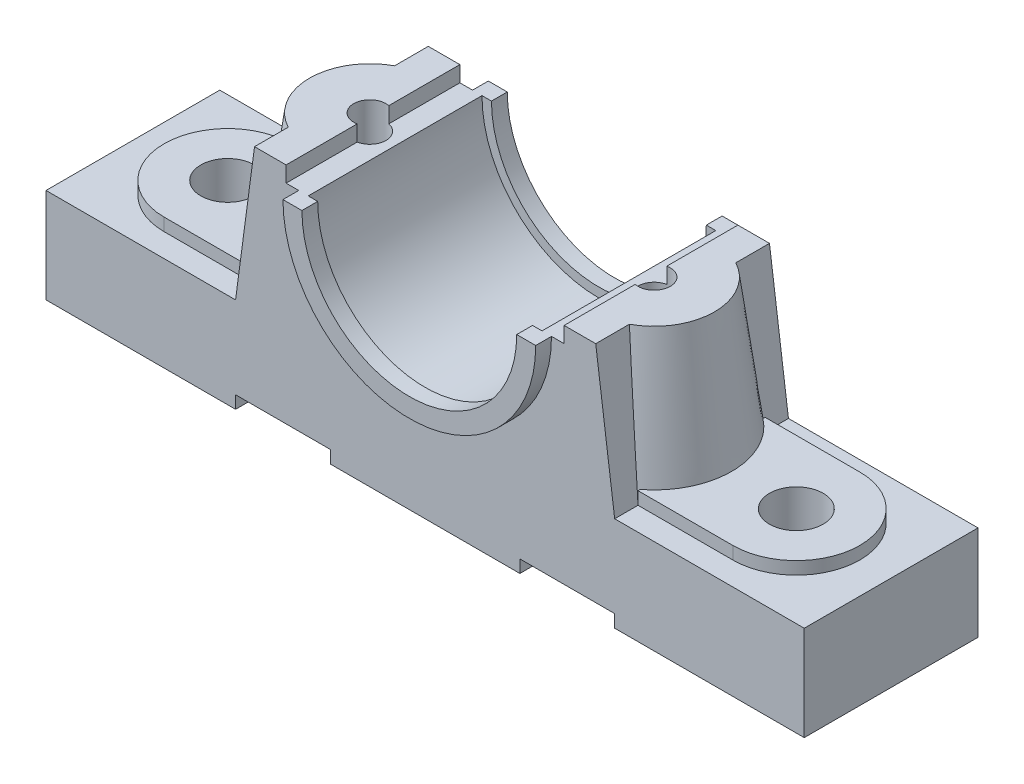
ISO-10303-21;
HEADER;
FILE_DESCRIPTION(('STEP AP214'),'2;1');
FILE_NAME('part.step','',(''),(''),'','','');
FILE_SCHEMA(('AUTOMOTIVE_DESIGN { 1 0 10303 214 1 1 1 1 }'));
ENDSEC;
DATA;
#1=APPLICATION_CONTEXT('core data for automotive mechanical design processes');
#2=APPLICATION_PROTOCOL_DEFINITION('international standard','automotive_design',2000,#1);
#3=PRODUCT_CONTEXT('',#1,'mechanical');
#4=PRODUCT('Part','Part','',(#3));
#5=PRODUCT_RELATED_PRODUCT_CATEGORY('part','',(#4));
#6=PRODUCT_DEFINITION_FORMATION('','',#4);
#7=PRODUCT_DEFINITION_CONTEXT('part definition',#1,'design');
#8=PRODUCT_DEFINITION('design','',#6,#7);
#9=PRODUCT_DEFINITION_SHAPE('','',#8);
#10=(LENGTH_UNIT() NAMED_UNIT(*) SI_UNIT(.MILLI.,.METRE.));
#11=(NAMED_UNIT(*) PLANE_ANGLE_UNIT() SI_UNIT($,.RADIAN.));
#12=(NAMED_UNIT(*) SI_UNIT($,.STERADIAN.) SOLID_ANGLE_UNIT());
#13=UNCERTAINTY_MEASURE_WITH_UNIT(LENGTH_MEASURE(1.E-05),#10,'distance_accuracy_value','');
#14=(GEOMETRIC_REPRESENTATION_CONTEXT(3) GLOBAL_UNCERTAINTY_ASSIGNED_CONTEXT((#13)) GLOBAL_UNIT_ASSIGNED_CONTEXT((#10,
#11,#12)) REPRESENTATION_CONTEXT('',''));
#15=CARTESIAN_POINT('',(0.,0.,0.));
#16=DIRECTION('',(0.,0.,1.));
#17=DIRECTION('',(1.,0.,0.));
#18=AXIS2_PLACEMENT_3D('',#15,#16,#17);
#19=CARTESIAN_POINT('',(-30.,4.,27.5));
#20=DIRECTION('',(0.,1.,0.));
#21=DIRECTION('',(-1.,0.,0.));
#22=AXIS2_PLACEMENT_3D('',#19,#20,#21);
#23=PLANE('',#22);
#24=DIRECTION('',(-1.,0.,0.));
#25=VECTOR('',#24,1.);
#26=CARTESIAN_POINT('',(-30.,4.,15.));
#27=LINE('',#26,#25);
#28=CARTESIAN_POINT('',(-30.,4.,15.));
#29=VERTEX_POINT('',#28);
#30=CARTESIAN_POINT('',(-60.,4.,15.));
#31=VERTEX_POINT('',#30);
#32=EDGE_CURVE('E741',#29,#31,#27,.T.);
#33=ORIENTED_EDGE('',*,*,#32,.F.);
#34=DIRECTION('',(0.,0.,-1.));
#35=VECTOR('',#34,1.);
#36=CARTESIAN_POINT('',(-30.,4.,27.5));
#37=LINE('',#36,#35);
#38=CARTESIAN_POINT('',(-30.,4.,27.5));
#39=VERTEX_POINT('',#38);
#40=EDGE_CURVE('E744',#39,#29,#37,.T.);
#41=ORIENTED_EDGE('',*,*,#40,.F.);
#42=DIRECTION('',(1.,0.,0.));
#43=VECTOR('',#42,1.);
#44=CARTESIAN_POINT('',(-30.,4.,27.5));
#45=LINE('',#44,#43);
#46=CARTESIAN_POINT('',(-60.,4.,27.5));
#47=VERTEX_POINT('',#46);
#48=EDGE_CURVE('E847',#47,#39,#45,.T.);
#49=ORIENTED_EDGE('',*,*,#48,.F.);
#50=DIRECTION('',(0.,0.,-1.));
#51=VECTOR('',#50,1.);
#52=CARTESIAN_POINT('',(-60.,4.,27.5));
#53=LINE('',#52,#51);
#54=EDGE_CURVE('E747',#47,#31,#53,.T.);
#55=ORIENTED_EDGE('',*,*,#54,.T.);
#56=EDGE_LOOP('',(#33,#41,#49,#55));
#57=FACE_BOUND('',#56,.T.);
#58=ADVANCED_FACE('F31',(#57),#23,.F.);
#59=CARTESIAN_POINT('',(-44.,70.,-27.5));
#60=DIRECTION('',(-1.,0.,0.));
#61=DIRECTION('',(0.,0.,1.));
#62=AXIS2_PLACEMENT_3D('',#59,#60,#61);
#63=PLANE('',#62);
#64=DIRECTION('',(0.,0.,1.));
#65=VECTOR('',#64,1.);
#66=CARTESIAN_POINT('',(-44.,70.,-27.5));
#67=LINE('',#66,#65);
#68=CARTESIAN_POINT('',(-44.,70.,5.00099990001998));
#69=VERTEX_POINT('',#68);
#70=CARTESIAN_POINT('',(-44.,70.,27.5));
#71=VERTEX_POINT('',#70);
#72=EDGE_CURVE('E637',#69,#71,#67,.T.);
#73=ORIENTED_EDGE('',*,*,#72,.F.);
#74=DIRECTION('',(0.,1.,0.));
#75=VECTOR('',#74,1.);
#76=CARTESIAN_POINT('',(-44.,75.,5.00099990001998));
#77=LINE('',#76,#75);
#78=CARTESIAN_POINT('',(-44.,75.,5.00099990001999));
#79=VERTEX_POINT('',#78);
#80=EDGE_CURVE('E11',#69,#79,#77,.T.);
#81=ORIENTED_EDGE('',*,*,#80,.T.);
#82=DIRECTION('',(0.,0.,1.));
#83=VECTOR('',#82,1.);
#84=CARTESIAN_POINT('',(-44.,75.,-27.5));
#85=LINE('',#84,#83);
#86=CARTESIAN_POINT('',(-44.,75.,27.5));
#87=VERTEX_POINT('',#86);
#88=EDGE_CURVE('E636',#79,#87,#85,.T.);
#89=ORIENTED_EDGE('',*,*,#88,.T.);
#90=DIRECTION('',(0.,-1.,0.));
#91=VECTOR('',#90,1.);
#92=CARTESIAN_POINT('',(-44.,70.,27.5));
#93=LINE('',#92,#91);
#94=EDGE_CURVE('E1441',#87,#71,#93,.T.);
#95=ORIENTED_EDGE('',*,*,#94,.T.);
#96=EDGE_LOOP('',(#73,#81,#89,#95));
#97=FACE_BOUND('',#96,.T.);
#98=ADVANCED_FACE('F576',(#97),#63,.F.);
#99=CARTESIAN_POINT('',(-40.,70.,-27.5));
#100=DIRECTION('',(0.,-1.,0.));
#101=DIRECTION('',(1.,0.,0.));
#102=AXIS2_PLACEMENT_3D('',#99,#100,#101);
#103=PLANE('',#102);
#104=CARTESIAN_POINT('',(-44.,70.,-27.5));
#105=VERTEX_POINT('',#104);
#106=CARTESIAN_POINT('',(-44.,70.,-5.00099990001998));
#107=VERTEX_POINT('',#106);
#108=EDGE_CURVE('E627',#105,#107,#67,.T.);
#109=ORIENTED_EDGE('',*,*,#108,.T.);
#110=CARTESIAN_POINT('',(-45.,70.,0.));
#111=DIRECTION('',(0.,-1.,0.));
#112=DIRECTION('',(1.,0.,0.));
#113=AXIS2_PLACEMENT_3D('',#110,#111,#112);
#114=CIRCLE('',#113,5.09999999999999);
#115=EDGE_CURVE('E55',#107,#69,#114,.T.);
#116=ORIENTED_EDGE('',*,*,#115,.T.);
#117=ORIENTED_EDGE('',*,*,#72,.T.);
#118=DIRECTION('',(1.,0.,0.));
#119=VECTOR('',#118,1.);
#120=CARTESIAN_POINT('',(-40.,70.,27.5));
#121=LINE('',#120,#119);
#122=CARTESIAN_POINT('',(-40.,70.,27.5));
#123=VERTEX_POINT('',#122);
#124=EDGE_CURVE('E1449',#71,#123,#121,.T.);
#125=ORIENTED_EDGE('',*,*,#124,.T.);
#126=DIRECTION('',(0.,0.,-1.));
#127=VECTOR('',#126,1.);
#128=CARTESIAN_POINT('',(-40.,70.,32.5));
#129=LINE('',#128,#127);
#130=CARTESIAN_POINT('',(-40.,70.,32.5));
#131=VERTEX_POINT('',#130);
#132=EDGE_CURVE('E1434',#131,#123,#129,.T.);
#133=ORIENTED_EDGE('',*,*,#132,.F.);
#134=DIRECTION('',(-1.,0.,0.));
#135=VECTOR('',#134,1.);
#136=CARTESIAN_POINT('',(-40.,70.,32.5));
#137=LINE('',#136,#135);
#138=CARTESIAN_POINT('',(-34.,70.,32.5));
#139=VERTEX_POINT('',#138);
#140=EDGE_CURVE('E1462',#139,#131,#137,.T.);
#141=ORIENTED_EDGE('',*,*,#140,.F.);
#142=DIRECTION('',(0.,0.,-1.));
#143=VECTOR('',#142,1.);
#144=CARTESIAN_POINT('',(-34.,70.,32.5));
#145=LINE('',#144,#143);
#146=CARTESIAN_POINT('',(-34.,70.,27.5));
#147=VERTEX_POINT('',#146);
#148=EDGE_CURVE('E1438',#139,#147,#145,.T.);
#149=ORIENTED_EDGE('',*,*,#148,.T.);
#150=DIRECTION('',(-1.,0.,0.));
#151=VECTOR('',#150,1.);
#152=CARTESIAN_POINT('',(-37.,70.,27.5));
#153=LINE('',#152,#151);
#154=CARTESIAN_POINT('',(-37.,70.,27.5));
#155=VERTEX_POINT('',#154);
#156=EDGE_CURVE('E1465',#147,#155,#153,.T.);
#157=ORIENTED_EDGE('',*,*,#156,.T.);
#158=DIRECTION('',(0.,0.,1.));
#159=VECTOR('',#158,1.);
#160=CARTESIAN_POINT('',(-37.,70.,-27.5));
#161=LINE('',#160,#159);
#162=CARTESIAN_POINT('',(-37.,70.,-27.5));
#163=VERTEX_POINT('',#162);
#164=EDGE_CURVE('E1424',#163,#155,#161,.T.);
#165=ORIENTED_EDGE('',*,*,#164,.F.);
#166=DIRECTION('',(-1.,0.,0.));
#167=VECTOR('',#166,1.);
#168=CARTESIAN_POINT('',(-37.,70.,-27.5));
#169=LINE('',#168,#167);
#170=CARTESIAN_POINT('',(-34.,70.,-27.5));
#171=VERTEX_POINT('',#170);
#172=EDGE_CURVE('E1411',#171,#163,#169,.T.);
#173=ORIENTED_EDGE('',*,*,#172,.F.);
#174=CARTESIAN_POINT('',(-34.,70.,-32.5));
#175=VERTEX_POINT('',#174);
#176=EDGE_CURVE('E1408',#171,#175,#145,.T.);
#177=ORIENTED_EDGE('',*,*,#176,.T.);
#178=DIRECTION('',(-1.,0.,0.));
#179=VECTOR('',#178,1.);
#180=CARTESIAN_POINT('',(-40.,70.,-32.5));
#181=LINE('',#180,#179);
#182=CARTESIAN_POINT('',(-40.,70.,-32.5));
#183=VERTEX_POINT('',#182);
#184=EDGE_CURVE('E1423',#175,#183,#181,.T.);
#185=ORIENTED_EDGE('',*,*,#184,.T.);
#186=CARTESIAN_POINT('',(-40.,70.,-27.5));
#187=VERTEX_POINT('',#186);
#188=EDGE_CURVE('E1437',#187,#183,#129,.T.);
#189=ORIENTED_EDGE('',*,*,#188,.F.);
#190=DIRECTION('',(1.,0.,0.));
#191=VECTOR('',#190,1.);
#192=CARTESIAN_POINT('',(-40.,70.,-27.5));
#193=LINE('',#192,#191);
#194=EDGE_CURVE('E634',#105,#187,#193,.T.);
#195=ORIENTED_EDGE('',*,*,#194,.F.);
#196=EDGE_LOOP('',(#109,#116,#117,#125,#133,#141,#149,#157,#165,#173,#177,#185,#189,#195));
#197=FACE_BOUND('',#196,.T.);
#198=ADVANCED_FACE('F573',(#197),#103,.F.);
#199=CARTESIAN_POINT('',(0.,70.,32.5));
#200=DIRECTION('',(0.,0.,-1.));
#201=DIRECTION('',(-1.,0.,0.));
#202=AXIS2_PLACEMENT_3D('',#199,#200,#201);
#203=CYLINDRICAL_SURFACE('',#202,34.);
#204=CARTESIAN_POINT('',(0.,70.,-27.5));
#205=DIRECTION('',(0.,0.,-1.));
#206=DIRECTION('',(1.,0.,0.));
#207=AXIS2_PLACEMENT_3D('',#204,#205,#206);
#208=CIRCLE('',#207,34.);
#209=CARTESIAN_POINT('',(34.,70.,-27.5));
#210=VERTEX_POINT('',#209);
#211=EDGE_CURVE('E1403',#210,#171,#208,.T.);
#212=ORIENTED_EDGE('',*,*,#211,.F.);
#213=DIRECTION('',(0.,0.,-1.));
#214=VECTOR('',#213,1.);
#215=CARTESIAN_POINT('',(34.,70.,32.5));
#216=LINE('',#215,#214);
#217=CARTESIAN_POINT('',(34.,70.,-32.5));
#218=VERTEX_POINT('',#217);
#219=EDGE_CURVE('E435',#210,#218,#216,.T.);
#220=ORIENTED_EDGE('',*,*,#219,.T.);
#221=CARTESIAN_POINT('',(0.,70.,-32.5));
#222=DIRECTION('',(0.,0.,-1.));
#223=DIRECTION('',(1.,0.,0.));
#224=AXIS2_PLACEMENT_3D('',#221,#222,#223);
#225=CIRCLE('',#224,34.);
#226=EDGE_CURVE('E1421',#218,#175,#225,.T.);
#227=ORIENTED_EDGE('',*,*,#226,.T.);
#228=ORIENTED_EDGE('',*,*,#176,.F.);
#229=EDGE_LOOP('',(#212,#220,#227,#228));
#230=FACE_BOUND('',#229,.T.);
#231=ADVANCED_FACE('F572',(#230),#203,.F.);
#232=CARTESIAN_POINT('',(-120.,30.,27.5));
#233=DIRECTION('',(0.,-1.,0.));
#234=DIRECTION('',(1.,0.,0.));
#235=AXIS2_PLACEMENT_3D('',#232,#233,#234);
#236=PLANE('',#235);
#237=DIRECTION('',(-1.,0.,0.));
#238=VECTOR('',#237,1.);
#239=CARTESIAN_POINT('',(-60.,30.,-20.110512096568));
#240=LINE('',#239,#238);
#241=CARTESIAN_POINT('',(-60.,30.,-20.110512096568));
#242=VERTEX_POINT('',#241);
#243=CARTESIAN_POINT('',(-90.,30.,-20.110512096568));
#244=VERTEX_POINT('',#243);
#245=EDGE_CURVE('E646',#242,#244,#240,.T.);
#246=ORIENTED_EDGE('',*,*,#245,.F.);
#247=DIRECTION('',(0.,0.,-1.));
#248=VECTOR('',#247,1.);
#249=CARTESIAN_POINT('',(-60.,30.,27.5));
#250=LINE('',#249,#248);
#251=CARTESIAN_POINT('',(-60.,30.,-27.5));
#252=VERTEX_POINT('',#251);
#253=EDGE_CURVE('E773',#242,#252,#250,.T.);
#254=ORIENTED_EDGE('',*,*,#253,.T.);
#255=DIRECTION('',(-1.,0.,0.));
#256=VECTOR('',#255,1.);
#257=CARTESIAN_POINT('',(-120.,30.,-27.5));
#258=LINE('',#257,#256);
#259=CARTESIAN_POINT('',(-120.,30.,-27.5));
#260=VERTEX_POINT('',#259);
#261=EDGE_CURVE('E814',#252,#260,#258,.T.);
#262=ORIENTED_EDGE('',*,*,#261,.T.);
#263=DIRECTION('',(0.,0.,-1.));
#264=VECTOR('',#263,1.);
#265=CARTESIAN_POINT('',(-120.,30.,27.5));
#266=LINE('',#265,#264);
#267=CARTESIAN_POINT('',(-120.,30.,27.5));
#268=VERTEX_POINT('',#267);
#269=EDGE_CURVE('E770',#268,#260,#266,.T.);
#270=ORIENTED_EDGE('',*,*,#269,.F.);
#271=DIRECTION('',(-1.,0.,0.));
#272=VECTOR('',#271,1.);
#273=CARTESIAN_POINT('',(-120.,30.,27.5));
#274=LINE('',#273,#272);
#275=CARTESIAN_POINT('',(-60.,30.,27.5));
#276=VERTEX_POINT('',#275);
#277=EDGE_CURVE('E796',#276,#268,#274,.T.);
#278=ORIENTED_EDGE('',*,*,#277,.F.);
#279=CARTESIAN_POINT('',(-60.,30.,20.110512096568));
#280=VERTEX_POINT('',#279);
#281=EDGE_CURVE('E774',#276,#280,#250,.T.);
#282=ORIENTED_EDGE('',*,*,#281,.T.);
#283=DIRECTION('',(1.,0.,0.));
#284=VECTOR('',#283,1.);
#285=CARTESIAN_POINT('',(-90.,30.,20.110512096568));
#286=LINE('',#285,#284);
#287=CARTESIAN_POINT('',(-90.,30.,20.110512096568));
#288=VERTEX_POINT('',#287);
#289=EDGE_CURVE('E663',#288,#280,#286,.T.);
#290=ORIENTED_EDGE('',*,*,#289,.F.);
#291=CARTESIAN_POINT('',(-90.,30.,0.));
#292=DIRECTION('',(0.,1.,0.));
#293=DIRECTION('',(-1.,0.,0.));
#294=AXIS2_PLACEMENT_3D('',#291,#292,#293);
#295=CIRCLE('',#294,20.110512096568);
#296=EDGE_CURVE('E661',#244,#288,#295,.T.);
#297=ORIENTED_EDGE('',*,*,#296,.F.);
#298=EDGE_LOOP('',(#246,#254,#262,#270,#278,#282,#290,#297));
#299=FACE_BOUND('',#298,.T.);
#300=ADVANCED_FACE('F696',(#299),#236,.F.);
#301=CARTESIAN_POINT('',(-45.,75.,0.));
#302=DIRECTION('',(0.,-1.,0.));
#303=DIRECTION('',(0.,0.,-1.));
#304=AXIS2_PLACEMENT_3D('',#301,#302,#303);
#305=CONICAL_SURFACE('',#304,19.0884973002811,0.132551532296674);
#306=CARTESIAN_POINT('',(-60.,75.7688743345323,-11.6390491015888));
#307=CARTESIAN_POINT('',(-60.,75.0857406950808,-11.78762094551));
#308=CARTESIAN_POINT('',(-60.,74.4022438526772,-11.9345128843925));
#309=CARTESIAN_POINT('',(-60.,73.0346044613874,-12.2252462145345));
#310=CARTESIAN_POINT('',(-60.,72.3504619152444,-12.3690876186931));
#311=CARTESIAN_POINT('',(-60.,70.2972061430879,-12.7964959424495));
#312=CARTESIAN_POINT('',(-60.,68.9272367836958,-13.075953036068));
#313=CARTESIAN_POINT('',(-60.,66.1855681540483,-13.6257799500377));
#314=CARTESIAN_POINT('',(-60.,64.8138689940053,-13.8961503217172));
#315=CARTESIAN_POINT('',(-60.,62.0689802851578,-14.429249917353));
#316=CARTESIAN_POINT('',(-60.,60.6957907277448,-14.691979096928));
#317=CARTESIAN_POINT('',(-60.,57.9483781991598,-15.2108778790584));
#318=CARTESIAN_POINT('',(-60.,56.574155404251,-15.4670484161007));
#319=CARTESIAN_POINT('',(-60.,53.824670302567,-15.9737529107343));
#320=CARTESIAN_POINT('',(-60.,52.4494079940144,-16.2242868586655));
#321=CARTESIAN_POINT('',(-60.,48.322266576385,-16.9685568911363));
#322=CARTESIAN_POINT('',(-60.,45.5690622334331,-17.4549556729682));
#323=CARTESIAN_POINT('',(-60.,41.9848183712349,-18.077971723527));
#324=CARTESIAN_POINT('',(-60.,41.1549714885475,-18.2215054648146));
#325=CARTESIAN_POINT('',(-60.,39.4950575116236,-18.5072745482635));
#326=CARTESIAN_POINT('',(-60.,38.6649904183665,-18.6495098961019));
#327=CARTESIAN_POINT('',(-60.,36.1744429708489,-19.0744066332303));
#328=CARTESIAN_POINT('',(-60.,34.5136529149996,-19.3552523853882));
#329=CARTESIAN_POINT('',(-60.,29.2650547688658,-20.2359391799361));
#330=CARTESIAN_POINT('',(-60.,25.6759461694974,-20.8280328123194));
#331=CARTESIAN_POINT('',(-60.,18.4952418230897,-21.9969944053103));
#332=CARTESIAN_POINT('',(-60.,14.9036460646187,-22.5738622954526));
#333=CARTESIAN_POINT('',(-60.,7.71882683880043,-23.7154339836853));
#334=CARTESIAN_POINT('',(-60.,4.12560352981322,-24.2801387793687));
#335=CARTESIAN_POINT('',(-60.,-1.26535830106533,-25.1198185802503));
#336=CARTESIAN_POINT('',(-60.,-3.06252390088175,-25.3984808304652));
#337=CARTESIAN_POINT('',(-60.,-6.65719985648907,-25.9535659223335));
#338=CARTESIAN_POINT('',(-60.,-8.45471021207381,-26.229988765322));
#339=CARTESIAN_POINT('',(-60.,-10.2523754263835,-26.5054014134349));
#340=B_SPLINE_CURVE_WITH_KNOTS('',3,(#306,#307,#308,#309,#310,#311,#312,#313,#314,#315,#316,
#317,#318,#319,#320,#321,#322,#323,#324,#325,#326,#327,#328,#329,#330,#331,#332,#333,#334,#335,
#336,#337,#338,#339),.UNSPECIFIED.,.F.,.F.,(4,2,2,2,2,2,2,2,2,2,2,2,2,2,2,2,4),(0.,
2.09730389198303,4.19459891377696,8.38910301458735,12.5833521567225,16.7776256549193,
20.9712981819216,25.1649778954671,33.5524266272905,36.0789321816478,38.6054266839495,
43.6585267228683,54.5713366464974,65.4841970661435,76.3961589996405,81.8520823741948,
87.308002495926),.UNSPECIFIED.);
#341=CARTESIAN_POINT('',(-60.,34.,-19.4410924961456));
#342=VERTEX_POINT('',#341);
#343=EDGE_CURVE('E620',#342,#242,#340,.T.);
#344=ORIENTED_EDGE('',*,*,#343,.F.);
#345=CARTESIAN_POINT('',(-45.,34.,0.));
#346=DIRECTION('',(0.,1.,0.));
#347=DIRECTION('',(-1.,0.,0.));
#348=AXIS2_PLACEMENT_3D('',#345,#346,#347);
#349=CIRCLE('',#348,24.5551639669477);
#350=CARTESIAN_POINT('',(-60.,34.,19.4410924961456));
#351=VERTEX_POINT('',#350);
#352=EDGE_CURVE('E779',#342,#351,#349,.T.);
#353=ORIENTED_EDGE('',*,*,#352,.T.);
#354=CARTESIAN_POINT('',(-60.,-10.2523754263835,26.5054014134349));
#355=CARTESIAN_POINT('',(-60.,-8.45446247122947,26.2299508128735));
#356=CARTESIAN_POINT('',(-60.,-6.656704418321,25.9534897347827));
#357=CARTESIAN_POINT('',(-60.,-3.06153331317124,25.3983275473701));
#358=CARTESIAN_POINT('',(-60.,-1.26412026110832,25.1196264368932));
#359=CARTESIAN_POINT('',(-60.,4.12752215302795,24.279838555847));
#360=CARTESIAN_POINT('',(-60.,7.72117844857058,23.7150636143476));
#361=CARTESIAN_POINT('',(-60.,14.9059371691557,22.5734949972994));
#362=CARTESIAN_POINT('',(-60.,18.497039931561,21.9967034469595));
#363=CARTESIAN_POINT('',(-60.,25.676816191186,20.8278894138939));
#364=CARTESIAN_POINT('',(-60.,29.2654896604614,20.235866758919));
#365=CARTESIAN_POINT('',(-60.,34.6463582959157,19.3329848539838));
#366=CARTESIAN_POINT('',(-60.,36.4397947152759,19.0295199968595));
#367=CARTESIAN_POINT('',(-60.,40.0256931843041,18.4168893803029));
#368=CARTESIAN_POINT('',(-60.,41.818155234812,18.1077236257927));
#369=CARTESIAN_POINT('',(-60.,45.4018755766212,17.4827861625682));
#370=CARTESIAN_POINT('',(-60.,47.1931339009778,17.1670146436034));
#371=CARTESIAN_POINT('',(-60.,50.7742716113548,16.5277000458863));
#372=CARTESIAN_POINT('',(-60.,52.5641509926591,16.204156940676));
#373=CARTESIAN_POINT('',(-60.,56.1425484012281,15.547759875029));
#374=CARTESIAN_POINT('',(-60.,57.9310661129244,15.2149041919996));
#375=CARTESIAN_POINT('',(-60.,61.505974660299,14.5380153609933));
#376=CARTESIAN_POINT('',(-60.,63.2923655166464,14.1939823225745));
#377=CARTESIAN_POINT('',(-60.,65.9700003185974,13.6675530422));
#378=CARTESIAN_POINT('',(-60.,66.8622637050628,13.4903377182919));
#379=CARTESIAN_POINT('',(-60.,68.6460083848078,13.1320199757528));
#380=CARTESIAN_POINT('',(-60.,69.5374896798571,12.9509175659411));
#381=CARTESIAN_POINT('',(-60.,71.3195823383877,12.5843303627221));
#382=CARTESIAN_POINT('',(-60.,72.2101936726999,12.3988454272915));
#383=CARTESIAN_POINT('',(-60.,73.9903645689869,12.0228639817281));
#384=CARTESIAN_POINT('',(-60.,74.8799241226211,11.8323674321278));
#385=CARTESIAN_POINT('',(-60.,75.7688743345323,11.6390491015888));
#386=B_SPLINE_CURVE_WITH_KNOTS('',3,(#354,#355,#356,#357,#358,#359,#360,#361,#362,#363,#364,
#365,#366,#367,#368,#369,#370,#371,#372,#373,#374,#375,#376,#377,#378,#379,#380,#381,#382,#383,
#384,#385),.UNSPECIFIED.,.F.,.F.,(4,2,2,2,2,2,2,2,2,2,2,2,2,2,2,4),(0.,5.45667201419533,
10.9133468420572,21.8266246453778,32.7379884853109,43.6494757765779,49.1062574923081,
54.5630344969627,60.0196549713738,65.476294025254,70.9339491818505,76.3915508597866,
79.1206193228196,81.8496815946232,84.5788324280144,87.3080047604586),.UNSPECIFIED.);
#387=EDGE_CURVE('E614',#280,#351,#386,.T.);
#388=ORIENTED_EDGE('',*,*,#387,.F.);
#389=CARTESIAN_POINT('',(-60.0000266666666,29.9998,20.110525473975));
#390=CARTESIAN_POINT('',(-59.4998151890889,33.7513860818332,19.8595481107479));
#391=CARTESIAN_POINT('',(-58.9996434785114,37.5026739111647,19.6039807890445));
#392=CARTESIAN_POINT('',(-57.9994010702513,45.0044919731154,19.082325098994));
#393=CARTESIAN_POINT('',(-57.4993303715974,48.7550222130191,18.8162368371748));
#394=CARTESIAN_POINT('',(-56.4992996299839,56.2552527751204,18.2721921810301));
#395=CARTESIAN_POINT('',(-55.9993395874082,60.0049530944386,17.9942357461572));
#396=CARTESIAN_POINT('',(-55.2494988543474,65.6287585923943,17.5670748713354));
#397=CARTESIAN_POINT('',(-54.9995672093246,67.5032459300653,17.4229827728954));
#398=CARTESIAN_POINT('',(-54.4997413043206,71.2519402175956,17.1311196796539));
#399=CARTESIAN_POINT('',(-54.2498470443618,73.1261471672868,16.9833486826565));
#400=CARTESIAN_POINT('',(-53.9999733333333,75.0002,16.8336030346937));
#401=B_SPLINE_CURVE_WITH_KNOTS('',3,(#389,#390,#391,#392,#393,#394,#395,#396,#397,#398,#399,
#400),.UNSPECIFIED.,.F.,.F.,(4,2,2,2,2,4),(0.,11.3792988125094,22.7584824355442,
34.1377049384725,39.8273748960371,45.5170482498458),.UNSPECIFIED.);
#402=CARTESIAN_POINT('',(-54.,75.,16.8336190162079));
#403=VERTEX_POINT('',#402);
#404=EDGE_CURVE('E679',#280,#403,#401,.T.);
#405=ORIENTED_EDGE('',*,*,#404,.T.);
#406=CARTESIAN_POINT('',(-45.,75.,0.));
#407=DIRECTION('',(0.,-1.,0.));
#408=DIRECTION('',(0.,0.,-1.));
#409=AXIS2_PLACEMENT_3D('',#406,#407,#408);
#410=CIRCLE('',#409,19.0884973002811);
#411=CARTESIAN_POINT('',(-54.,75.,-16.8336190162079));
#412=VERTEX_POINT('',#411);
#413=EDGE_CURVE('E676',#403,#412,#410,.T.);
#414=ORIENTED_EDGE('',*,*,#413,.T.);
#415=CARTESIAN_POINT('',(-53.9999733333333,75.0002,-16.8336030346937));
#416=CARTESIAN_POINT('',(-54.3702079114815,72.2234406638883,-17.0554589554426));
#417=CARTESIAN_POINT('',(-54.740487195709,69.4463460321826,-17.2730115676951));
#418=CARTESIAN_POINT('',(-55.4811239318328,63.8915705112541,-17.7003181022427));
#419=CARTESIAN_POINT('',(-55.8514813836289,61.1138896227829,-17.9100720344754));
#420=CARTESIAN_POINT('',(-56.5922591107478,55.5580566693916,-18.3225868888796));
#421=CARTESIAN_POINT('',(-56.9626793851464,52.7799046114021,-18.5253479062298));
#422=CARTESIAN_POINT('',(-57.7035796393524,47.2231527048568,-18.9245260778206));
#423=CARTESIAN_POINT('',(-58.0740596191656,44.4445528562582,-19.1209432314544));
#424=CARTESIAN_POINT('',(-58.7037842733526,39.7216179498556,-19.449865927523));
#425=CARTESIAN_POINT('',(-58.9630155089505,37.7773836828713,-19.5838475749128));
#426=CARTESIAN_POINT('',(-59.4815030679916,33.8887269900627,-19.8491450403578));
#427=CARTESIAN_POINT('',(-59.7407593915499,31.9443045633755,-19.9804608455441));
#428=CARTESIAN_POINT('',(-60.0000266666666,29.9998,-20.1105254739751));
#429=B_SPLINE_CURVE_WITH_KNOTS('',3,(#415,#416,#417,#418,#419,#420,#421,#422,#423,#424,#425,
#426,#427,#428),.UNSPECIFIED.,.F.,.F.,(4,2,2,2,2,2,4),(0.,8.43030585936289,16.8606009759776,
25.2907813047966,33.7209624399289,39.6189933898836,45.5170528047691),.UNSPECIFIED.);
#430=EDGE_CURVE('E685',#412,#242,#429,.T.);
#431=ORIENTED_EDGE('',*,*,#430,.T.);
#432=EDGE_LOOP('',(#344,#353,#388,#405,#414,#431));
#433=FACE_BOUND('',#432,.T.);
#434=ADVANCED_FACE('F609',(#433),#305,.T.);
#435=CARTESIAN_POINT('',(-60.,30.,27.5));
#436=DIRECTION('',(0.991227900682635,-0.132163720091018,0.));
#437=DIRECTION('',(0.132163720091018,0.991227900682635,0.));
#438=AXIS2_PLACEMENT_3D('',#435,#436,#437);
#439=PLANE('',#438);
#440=ORIENTED_EDGE('',*,*,#430,.F.);
#441=DIRECTION('',(0.,0.,-1.));
#442=VECTOR('',#441,1.);
#443=CARTESIAN_POINT('',(-54.,75.,27.5));
#444=LINE('',#443,#442);
#445=CARTESIAN_POINT('',(-54.,75.,-27.5));
#446=VERTEX_POINT('',#445);
#447=EDGE_CURVE('E777',#412,#446,#444,.T.);
#448=ORIENTED_EDGE('',*,*,#447,.T.);
#449=DIRECTION('',(-0.132163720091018,-0.991227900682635,0.));
#450=VECTOR('',#449,1.);
#451=CARTESIAN_POINT('',(-60.,30.,-27.5));
#452=LINE('',#451,#450);
#453=EDGE_CURVE('E810',#446,#252,#452,.T.);
#454=ORIENTED_EDGE('',*,*,#453,.T.);
#455=ORIENTED_EDGE('',*,*,#253,.F.);
#456=EDGE_LOOP('',(#440,#448,#454,#455));
#457=FACE_BOUND('',#456,.T.);
#458=ADVANCED_FACE('F690',(#457),#439,.F.);
#459=ORIENTED_EDGE('',*,*,#404,.F.);
#460=ORIENTED_EDGE('',*,*,#281,.F.);
#461=DIRECTION('',(-0.132163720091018,-0.991227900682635,0.));
#462=VECTOR('',#461,1.);
#463=CARTESIAN_POINT('',(-60.,30.,27.5));
#464=LINE('',#463,#462);
#465=CARTESIAN_POINT('',(-54.,75.,27.5));
#466=VERTEX_POINT('',#465);
#467=EDGE_CURVE('E800',#466,#276,#464,.T.);
#468=ORIENTED_EDGE('',*,*,#467,.F.);
#469=EDGE_CURVE('E778',#466,#403,#444,.T.);
#470=ORIENTED_EDGE('',*,*,#469,.T.);
#471=EDGE_LOOP('',(#459,#460,#468,#470));
#472=FACE_BOUND('',#471,.T.);
#473=ADVANCED_FACE('F694',(#472),#439,.F.);
#474=CARTESIAN_POINT('',(-54.,75.,27.5));
#475=DIRECTION('',(0.,-1.,0.));
#476=DIRECTION('',(0.,0.,-1.));
#477=AXIS2_PLACEMENT_3D('',#474,#475,#476);
#478=PLANE('',#477);
#479=ORIENTED_EDGE('',*,*,#88,.F.);
#480=CARTESIAN_POINT('',(-45.,75.,0.));
#481=DIRECTION('',(0.,1.,0.));
#482=DIRECTION('',(0.,0.,1.));
#483=AXIS2_PLACEMENT_3D('',#480,#481,#482);
#484=CIRCLE('',#483,5.09999999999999);
#485=CARTESIAN_POINT('',(-44.,75.,-5.00099990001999));
#486=VERTEX_POINT('',#485);
#487=EDGE_CURVE('E1476',#486,#79,#484,.T.);
#488=ORIENTED_EDGE('',*,*,#487,.F.);
#489=CARTESIAN_POINT('',(-44.,75.,-27.5));
#490=VERTEX_POINT('',#489);
#491=EDGE_CURVE('E630',#490,#486,#85,.T.);
#492=ORIENTED_EDGE('',*,*,#491,.F.);
#493=DIRECTION('',(-1.,0.,0.));
#494=VECTOR('',#493,1.);
#495=CARTESIAN_POINT('',(-54.,75.,-27.5));
#496=LINE('',#495,#494);
#497=EDGE_CURVE('E809',#490,#446,#496,.T.);
#498=ORIENTED_EDGE('',*,*,#497,.T.);
#499=ORIENTED_EDGE('',*,*,#447,.F.);
#500=ORIENTED_EDGE('',*,*,#413,.F.);
#501=ORIENTED_EDGE('',*,*,#469,.F.);
#502=DIRECTION('',(-1.,0.,0.));
#503=VECTOR('',#502,1.);
#504=CARTESIAN_POINT('',(-54.,75.,27.5));
#505=LINE('',#504,#503);
#506=EDGE_CURVE('E804',#87,#466,#505,.T.);
#507=ORIENTED_EDGE('',*,*,#506,.F.);
#508=EDGE_LOOP('',(#479,#488,#492,#498,#499,#500,#501,#507));
#509=FACE_BOUND('',#508,.T.);
#510=ADVANCED_FACE('F33',(#509),#478,.F.);
#511=CARTESIAN_POINT('',(-120.,0.,27.5));
#512=DIRECTION('',(1.,0.,0.));
#513=DIRECTION('',(0.,0.,-1.));
#514=AXIS2_PLACEMENT_3D('',#511,#512,#513);
#515=PLANE('',#514);
#516=DIRECTION('',(0.,-1.,0.));
#517=VECTOR('',#516,1.);
#518=CARTESIAN_POINT('',(-120.,0.,-27.5));
#519=LINE('',#518,#517);
#520=CARTESIAN_POINT('',(-120.,0.,-27.5));
#521=VERTEX_POINT('',#520);
#522=EDGE_CURVE('E821',#260,#521,#519,.T.);
#523=ORIENTED_EDGE('',*,*,#522,.T.);
#524=DIRECTION('',(0.,0.,-1.));
#525=VECTOR('',#524,1.);
#526=CARTESIAN_POINT('',(-120.,0.,27.5));
#527=LINE('',#526,#525);
#528=CARTESIAN_POINT('',(-120.,0.,27.5));
#529=VERTEX_POINT('',#528);
#530=EDGE_CURVE('E767',#529,#521,#527,.T.);
#531=ORIENTED_EDGE('',*,*,#530,.F.);
#532=DIRECTION('',(0.,-1.,0.));
#533=VECTOR('',#532,1.);
#534=CARTESIAN_POINT('',(-120.,0.,27.5));
#535=LINE('',#534,#533);
#536=EDGE_CURVE('E841',#268,#529,#535,.T.);
#537=ORIENTED_EDGE('',*,*,#536,.F.);
#538=ORIENTED_EDGE('',*,*,#269,.T.);
#539=EDGE_LOOP('',(#523,#531,#537,#538));
#540=FACE_BOUND('',#539,.T.);
#541=ADVANCED_FACE('F701',(#540),#515,.F.);
#542=CARTESIAN_POINT('',(-60.,0.,27.5));
#543=DIRECTION('',(0.,1.,0.));
#544=DIRECTION('',(-1.,0.,0.));
#545=AXIS2_PLACEMENT_3D('',#542,#543,#544);
#546=PLANE('',#545);
#547=CARTESIAN_POINT('',(-90.,0.,0.));
#548=DIRECTION('',(0.,1.,0.));
#549=DIRECTION('',(-1.,0.,0.));
#550=AXIS2_PLACEMENT_3D('',#547,#548,#549);
#551=CIRCLE('',#550,8.50000000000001);
#552=CARTESIAN_POINT('',(-98.5,0.,0.));
#553=VERTEX_POINT('',#552);
#554=EDGE_CURVE('E643',#553,#553,#551,.T.);
#555=ORIENTED_EDGE('',*,*,#554,.T.);
#556=EDGE_LOOP('',(#555));
#557=FACE_BOUND('',#556,.T.);
#558=DIRECTION('',(1.,0.,0.));
#559=VECTOR('',#558,1.);
#560=CARTESIAN_POINT('',(-60.,0.,-27.5));
#561=LINE('',#560,#559);
#562=CARTESIAN_POINT('',(-60.,0.,-27.5));
#563=VERTEX_POINT('',#562);
#564=EDGE_CURVE('E823',#521,#563,#561,.T.);
#565=ORIENTED_EDGE('',*,*,#564,.T.);
#566=DIRECTION('',(0.,0.,-1.));
#567=VECTOR('',#566,1.);
#568=CARTESIAN_POINT('',(-60.,0.,27.5));
#569=LINE('',#568,#567);
#570=CARTESIAN_POINT('',(-60.,0.,27.5));
#571=VERTEX_POINT('',#570);
#572=EDGE_CURVE('E765',#571,#563,#569,.T.);
#573=ORIENTED_EDGE('',*,*,#572,.F.);
#574=DIRECTION('',(1.,0.,0.));
#575=VECTOR('',#574,1.);
#576=CARTESIAN_POINT('',(-60.,0.,27.5));
#577=LINE('',#576,#575);
#578=EDGE_CURVE('E843',#529,#571,#577,.T.);
#579=ORIENTED_EDGE('',*,*,#578,.F.);
#580=ORIENTED_EDGE('',*,*,#530,.T.);
#581=EDGE_LOOP('',(#565,#573,#579,#580));
#582=FACE_BOUND('',#581,.T.);
#583=ADVANCED_FACE('F704',(#557,#582),#546,.F.);
#584=CARTESIAN_POINT('',(-60.,4.,27.5));
#585=DIRECTION('',(-1.,0.,0.));
#586=DIRECTION('',(0.,0.,1.));
#587=AXIS2_PLACEMENT_3D('',#584,#585,#586);
#588=PLANE('',#587);
#589=CARTESIAN_POINT('',(-60.,4.,-15.));
#590=VERTEX_POINT('',#589);
#591=CARTESIAN_POINT('',(-60.,4.,-27.5));
#592=VERTEX_POINT('',#591);
#593=EDGE_CURVE('E757',#590,#592,#53,.T.);
#594=ORIENTED_EDGE('',*,*,#593,.F.);
#595=DIRECTION('',(0.,-1.,0.));
#596=VECTOR('',#595,1.);
#597=CARTESIAN_POINT('',(-60.,0.,-15.));
#598=LINE('',#597,#596);
#599=CARTESIAN_POINT('',(-60.,15.,-15.));
#600=VERTEX_POINT('',#599);
#601=EDGE_CURVE('E1483',#600,#590,#598,.T.);
#602=ORIENTED_EDGE('',*,*,#601,.F.);
#603=DIRECTION('',(0.,0.,1.));
#604=VECTOR('',#603,1.);
#605=CARTESIAN_POINT('',(-60.,15.,-15.));
#606=LINE('',#605,#604);
#607=CARTESIAN_POINT('',(-60.,15.,15.));
#608=VERTEX_POINT('',#607);
#609=EDGE_CURVE('E1482',#600,#608,#606,.T.);
#610=ORIENTED_EDGE('',*,*,#609,.T.);
#611=DIRECTION('',(0.,-1.,0.));
#612=VECTOR('',#611,1.);
#613=CARTESIAN_POINT('',(-60.,0.,15.));
#614=LINE('',#613,#612);
#615=EDGE_CURVE('E1485',#608,#31,#614,.T.);
#616=ORIENTED_EDGE('',*,*,#615,.T.);
#617=ORIENTED_EDGE('',*,*,#54,.F.);
#618=DIRECTION('',(0.,1.,0.));
#619=VECTOR('',#618,1.);
#620=CARTESIAN_POINT('',(-60.,4.,27.5));
#621=LINE('',#620,#619);
#622=EDGE_CURVE('E845',#571,#47,#621,.T.);
#623=ORIENTED_EDGE('',*,*,#622,.F.);
#624=ORIENTED_EDGE('',*,*,#572,.T.);
#625=DIRECTION('',(0.,1.,0.));
#626=VECTOR('',#625,1.);
#627=CARTESIAN_POINT('',(-60.,4.,-27.5));
#628=LINE('',#627,#626);
#629=EDGE_CURVE('E826',#563,#592,#628,.T.);
#630=ORIENTED_EDGE('',*,*,#629,.T.);
#631=EDGE_LOOP('',(#594,#602,#610,#616,#617,#623,#624,#630));
#632=FACE_BOUND('',#631,.T.);
#633=ADVANCED_FACE('F708',(#632),#588,.F.);
#634=CARTESIAN_POINT('',(-30.,4.,-15.));
#635=VERTEX_POINT('',#634);
#636=CARTESIAN_POINT('',(-30.,4.,-27.5));
#637=VERTEX_POINT('',#636);
#638=EDGE_CURVE('E758',#635,#637,#37,.T.);
#639=ORIENTED_EDGE('',*,*,#638,.F.);
#640=DIRECTION('',(-1.,0.,0.));
#641=VECTOR('',#640,1.);
#642=CARTESIAN_POINT('',(-30.,4.,-15.));
#643=LINE('',#642,#641);
#644=EDGE_CURVE('E750',#635,#590,#643,.T.);
#645=ORIENTED_EDGE('',*,*,#644,.T.);
#646=ORIENTED_EDGE('',*,*,#593,.T.);
#647=DIRECTION('',(1.,0.,0.));
#648=VECTOR('',#647,1.);
#649=CARTESIAN_POINT('',(-30.,4.,-27.5));
#650=LINE('',#649,#648);
#651=EDGE_CURVE('E829',#592,#637,#650,.T.);
#652=ORIENTED_EDGE('',*,*,#651,.T.);
#653=EDGE_LOOP('',(#639,#645,#646,#652));
#654=FACE_BOUND('',#653,.T.);
#655=ADVANCED_FACE('F712',(#654),#23,.F.);
#656=CARTESIAN_POINT('',(-30.,0.,27.5));
#657=DIRECTION('',(1.,0.,0.));
#658=DIRECTION('',(0.,0.,-1.));
#659=AXIS2_PLACEMENT_3D('',#656,#657,#658);
#660=PLANE('',#659);
#661=DIRECTION('',(0.,-1.,0.));
#662=VECTOR('',#661,1.);
#663=CARTESIAN_POINT('',(-30.,0.,-27.5));
#664=LINE('',#663,#662);
#665=CARTESIAN_POINT('',(-30.,0.,-27.5));
#666=VERTEX_POINT('',#665);
#667=EDGE_CURVE('E832',#637,#666,#664,.T.);
#668=ORIENTED_EDGE('',*,*,#667,.T.);
#669=DIRECTION('',(0.,0.,-1.));
#670=VECTOR('',#669,1.);
#671=CARTESIAN_POINT('',(-30.,0.,27.5));
#672=LINE('',#671,#670);
#673=CARTESIAN_POINT('',(-30.,0.,27.5));
#674=VERTEX_POINT('',#673);
#675=EDGE_CURVE('E761',#674,#666,#672,.T.);
#676=ORIENTED_EDGE('',*,*,#675,.F.);
#677=DIRECTION('',(0.,-1.,0.));
#678=VECTOR('',#677,1.);
#679=CARTESIAN_POINT('',(-30.,0.,27.5));
#680=LINE('',#679,#678);
#681=EDGE_CURVE('E756',#39,#674,#680,.T.);
#682=ORIENTED_EDGE('',*,*,#681,.F.);
#683=ORIENTED_EDGE('',*,*,#40,.T.);
#684=DIRECTION('',(0.,1.,0.));
#685=VECTOR('',#684,1.);
#686=CARTESIAN_POINT('',(-30.,15.,15.));
#687=LINE('',#686,#685);
#688=CARTESIAN_POINT('',(-30.,15.,15.));
#689=VERTEX_POINT('',#688);
#690=EDGE_CURVE('E47',#29,#689,#687,.T.);
#691=ORIENTED_EDGE('',*,*,#690,.T.);
#692=DIRECTION('',(0.,0.,1.));
#693=VECTOR('',#692,1.);
#694=CARTESIAN_POINT('',(-30.,15.,-15.));
#695=LINE('',#694,#693);
#696=CARTESIAN_POINT('',(-30.,15.,-15.));
#697=VERTEX_POINT('',#696);
#698=EDGE_CURVE('E1480',#697,#689,#695,.T.);
#699=ORIENTED_EDGE('',*,*,#698,.F.);
#700=DIRECTION('',(0.,1.,0.));
#701=VECTOR('',#700,1.);
#702=CARTESIAN_POINT('',(-30.,15.,-15.));
#703=LINE('',#702,#701);
#704=EDGE_CURVE('E1487',#635,#697,#703,.T.);
#705=ORIENTED_EDGE('',*,*,#704,.F.);
#706=ORIENTED_EDGE('',*,*,#638,.T.);
#707=EDGE_LOOP('',(#668,#676,#682,#683,#691,#699,#705,#706));
#708=FACE_BOUND('',#707,.T.);
#709=ADVANCED_FACE('F716',(#708),#660,.F.);
#710=CARTESIAN_POINT('',(0.,0.,27.5));
#711=DIRECTION('',(0.,1.,0.));
#712=DIRECTION('',(0.,0.,1.));
#713=AXIS2_PLACEMENT_3D('',#710,#711,#712);
#714=PLANE('',#713);
#715=DIRECTION('',(1.,0.,0.));
#716=VECTOR('',#715,1.);
#717=CARTESIAN_POINT('',(0.,0.,-27.5));
#718=LINE('',#717,#716);
#719=CARTESIAN_POINT('',(30.,0.,-27.5));
#720=VERTEX_POINT('',#719);
#721=EDGE_CURVE('E833',#666,#720,#718,.T.);
#722=ORIENTED_EDGE('',*,*,#721,.T.);
#723=DIRECTION('',(0.,0.,-1.));
#724=VECTOR('',#723,1.);
#725=CARTESIAN_POINT('',(30.,0.,27.5));
#726=LINE('',#725,#724);
#727=CARTESIAN_POINT('',(30.,0.,27.5));
#728=VERTEX_POINT('',#727);
#729=EDGE_CURVE('E865',#728,#720,#726,.T.);
#730=ORIENTED_EDGE('',*,*,#729,.F.);
#731=DIRECTION('',(1.,0.,0.));
#732=VECTOR('',#731,1.);
#733=CARTESIAN_POINT('',(0.,0.,27.5));
#734=LINE('',#733,#732);
#735=EDGE_CURVE('E817',#674,#728,#734,.T.);
#736=ORIENTED_EDGE('',*,*,#735,.F.);
#737=ORIENTED_EDGE('',*,*,#675,.T.);
#738=EDGE_LOOP('',(#722,#730,#736,#737));
#739=FACE_BOUND('',#738,.T.);
#740=ADVANCED_FACE('F720',(#739),#714,.F.);
#741=CARTESIAN_POINT('',(0.,0.,27.5));
#742=DIRECTION('',(0.,0.,-1.));
#743=DIRECTION('',(-1.,0.,0.));
#744=AXIS2_PLACEMENT_3D('',#741,#742,#743);
#745=PLANE('',#744);
#746=ORIENTED_EDGE('',*,*,#124,.F.);
#747=ORIENTED_EDGE('',*,*,#94,.F.);
#748=ORIENTED_EDGE('',*,*,#506,.T.);
#749=ORIENTED_EDGE('',*,*,#467,.T.);
#750=ORIENTED_EDGE('',*,*,#277,.T.);
#751=ORIENTED_EDGE('',*,*,#536,.T.);
#752=ORIENTED_EDGE('',*,*,#578,.T.);
#753=ORIENTED_EDGE('',*,*,#622,.T.);
#754=ORIENTED_EDGE('',*,*,#48,.T.);
#755=ORIENTED_EDGE('',*,*,#681,.T.);
#756=ORIENTED_EDGE('',*,*,#735,.T.);
#757=DIRECTION('',(0.,-1.,0.));
#758=VECTOR('',#757,1.);
#759=CARTESIAN_POINT('',(30.,0.,27.5));
#760=LINE('',#759,#758);
#761=CARTESIAN_POINT('',(30.,4.,27.5));
#762=VERTEX_POINT('',#761);
#763=EDGE_CURVE('E867',#762,#728,#760,.T.);
#764=ORIENTED_EDGE('',*,*,#763,.F.);
#765=DIRECTION('',(-1.,0.,0.));
#766=VECTOR('',#765,1.);
#767=CARTESIAN_POINT('',(30.,4.,27.5));
#768=LINE('',#767,#766);
#769=CARTESIAN_POINT('',(60.,4.,27.5));
#770=VERTEX_POINT('',#769);
#771=EDGE_CURVE('E1546',#770,#762,#768,.T.);
#772=ORIENTED_EDGE('',*,*,#771,.F.);
#773=DIRECTION('',(0.,1.,0.));
#774=VECTOR('',#773,1.);
#775=CARTESIAN_POINT('',(60.,4.,27.5));
#776=LINE('',#775,#774);
#777=CARTESIAN_POINT('',(60.,0.,27.5));
#778=VERTEX_POINT('',#777);
#779=EDGE_CURVE('E1544',#778,#770,#776,.T.);
#780=ORIENTED_EDGE('',*,*,#779,.F.);
#781=DIRECTION('',(-1.,0.,0.));
#782=VECTOR('',#781,1.);
#783=CARTESIAN_POINT('',(60.,0.,27.5));
#784=LINE('',#783,#782);
#785=CARTESIAN_POINT('',(120.,0.,27.5));
#786=VERTEX_POINT('',#785);
#787=EDGE_CURVE('E1539',#786,#778,#784,.T.);
#788=ORIENTED_EDGE('',*,*,#787,.F.);
#789=DIRECTION('',(0.,-1.,0.));
#790=VECTOR('',#789,1.);
#791=CARTESIAN_POINT('',(120.,0.,27.5));
#792=LINE('',#791,#790);
#793=CARTESIAN_POINT('',(120.,30.,27.5));
#794=VERTEX_POINT('',#793);
#795=EDGE_CURVE('E1536',#794,#786,#792,.T.);
#796=ORIENTED_EDGE('',*,*,#795,.F.);
#797=DIRECTION('',(1.,0.,0.));
#798=VECTOR('',#797,1.);
#799=CARTESIAN_POINT('',(120.,30.,27.5));
#800=LINE('',#799,#798);
#801=CARTESIAN_POINT('',(60.,30.,27.5));
#802=VERTEX_POINT('',#801);
#803=EDGE_CURVE('E1533',#802,#794,#800,.T.);
#804=ORIENTED_EDGE('',*,*,#803,.F.);
#805=DIRECTION('',(0.132163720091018,-0.991227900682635,0.));
#806=VECTOR('',#805,1.);
#807=CARTESIAN_POINT('',(60.,30.,27.5));
#808=LINE('',#807,#806);
#809=CARTESIAN_POINT('',(54.,75.,27.5));
#810=VERTEX_POINT('',#809);
#811=EDGE_CURVE('E860',#810,#802,#808,.T.);
#812=ORIENTED_EDGE('',*,*,#811,.F.);
#813=DIRECTION('',(1.,0.,0.));
#814=VECTOR('',#813,1.);
#815=CARTESIAN_POINT('',(54.,75.,27.5));
#816=LINE('',#815,#814);
#817=CARTESIAN_POINT('',(44.,75.,27.5));
#818=VERTEX_POINT('',#817);
#819=EDGE_CURVE('E858',#818,#810,#816,.T.);
#820=ORIENTED_EDGE('',*,*,#819,.F.);
#821=DIRECTION('',(0.,-1.,0.));
#822=VECTOR('',#821,1.);
#823=CARTESIAN_POINT('',(44.,70.,27.5));
#824=LINE('',#823,#822);
#825=CARTESIAN_POINT('',(44.,70.,27.5));
#826=VERTEX_POINT('',#825);
#827=EDGE_CURVE('E439',#818,#826,#824,.T.);
#828=ORIENTED_EDGE('',*,*,#827,.T.);
#829=DIRECTION('',(-1.,0.,0.));
#830=VECTOR('',#829,1.);
#831=CARTESIAN_POINT('',(40.,70.,27.5));
#832=LINE('',#831,#830);
#833=CARTESIAN_POINT('',(40.,70.,27.5));
#834=VERTEX_POINT('',#833);
#835=EDGE_CURVE('E443',#826,#834,#832,.T.);
#836=ORIENTED_EDGE('',*,*,#835,.T.);
#837=CARTESIAN_POINT('',(0.,70.,27.5));
#838=DIRECTION('',(0.,0.,1.));
#839=DIRECTION('',(1.,0.,0.));
#840=AXIS2_PLACEMENT_3D('',#837,#838,#839);
#841=CIRCLE('',#840,40.);
#842=EDGE_CURVE('E1444',#123,#834,#841,.T.);
#843=ORIENTED_EDGE('',*,*,#842,.F.);
#844=EDGE_LOOP('',(#746,#747,#748,#749,#750,#751,#752,#753,#754,#755,#756,#764,#772,#780,#788,
#796,#804,#812,#820,#828,#836,#843));
#845=FACE_BOUND('',#844,.T.);
#846=ADVANCED_FACE('F724',(#845),#745,.F.);
#847=CARTESIAN_POINT('',(0.,0.,-27.5));
#848=DIRECTION('',(0.,0.,-1.));
#849=DIRECTION('',(-1.,0.,0.));
#850=AXIS2_PLACEMENT_3D('',#847,#848,#849);
#851=PLANE('',#850);
#852=DIRECTION('',(0.,-1.,0.));
#853=VECTOR('',#852,1.);
#854=CARTESIAN_POINT('',(-44.,70.,-27.5));
#855=LINE('',#854,#853);
#856=EDGE_CURVE('E1442',#490,#105,#855,.T.);
#857=ORIENTED_EDGE('',*,*,#856,.T.);
#858=ORIENTED_EDGE('',*,*,#194,.T.);
#859=CARTESIAN_POINT('',(0.,70.,-27.5));
#860=DIRECTION('',(0.,0.,1.));
#861=DIRECTION('',(1.,0.,0.));
#862=AXIS2_PLACEMENT_3D('',#859,#860,#861);
#863=CIRCLE('',#862,40.);
#864=CARTESIAN_POINT('',(40.,70.,-27.5));
#865=VERTEX_POINT('',#864);
#866=EDGE_CURVE('E640',#187,#865,#863,.T.);
#867=ORIENTED_EDGE('',*,*,#866,.T.);
#868=DIRECTION('',(-1.,0.,0.));
#869=VECTOR('',#868,1.);
#870=CARTESIAN_POINT('',(40.,70.,-27.5));
#871=LINE('',#870,#869);
#872=CARTESIAN_POINT('',(44.,70.,-27.5));
#873=VERTEX_POINT('',#872);
#874=EDGE_CURVE('E442',#873,#865,#871,.T.);
#875=ORIENTED_EDGE('',*,*,#874,.F.);
#876=DIRECTION('',(0.,-1.,0.));
#877=VECTOR('',#876,1.);
#878=CARTESIAN_POINT('',(44.,70.,-27.5));
#879=LINE('',#878,#877);
#880=CARTESIAN_POINT('',(44.,75.,-27.5));
#881=VERTEX_POINT('',#880);
#882=EDGE_CURVE('E440',#881,#873,#879,.T.);
#883=ORIENTED_EDGE('',*,*,#882,.F.);
#884=DIRECTION('',(1.,0.,0.));
#885=VECTOR('',#884,1.);
#886=CARTESIAN_POINT('',(54.,75.,-27.5));
#887=LINE('',#886,#885);
#888=CARTESIAN_POINT('',(54.,75.,-27.5));
#889=VERTEX_POINT('',#888);
#890=EDGE_CURVE('E1551',#881,#889,#887,.T.);
#891=ORIENTED_EDGE('',*,*,#890,.T.);
#892=DIRECTION('',(0.132163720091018,-0.991227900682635,0.));
#893=VECTOR('',#892,1.);
#894=CARTESIAN_POINT('',(60.,30.,-27.5));
#895=LINE('',#894,#893);
#896=CARTESIAN_POINT('',(60.,30.,-27.5));
#897=VERTEX_POINT('',#896);
#898=EDGE_CURVE('E1553',#889,#897,#895,.T.);
#899=ORIENTED_EDGE('',*,*,#898,.T.);
#900=DIRECTION('',(1.,0.,0.));
#901=VECTOR('',#900,1.);
#902=CARTESIAN_POINT('',(120.,30.,-27.5));
#903=LINE('',#902,#901);
#904=CARTESIAN_POINT('',(120.,30.,-27.5));
#905=VERTEX_POINT('',#904);
#906=EDGE_CURVE('E1517',#897,#905,#903,.T.);
#907=ORIENTED_EDGE('',*,*,#906,.T.);
#908=DIRECTION('',(0.,-1.,0.));
#909=VECTOR('',#908,1.);
#910=CARTESIAN_POINT('',(120.,0.,-27.5));
#911=LINE('',#910,#909);
#912=CARTESIAN_POINT('',(120.,0.,-27.5));
#913=VERTEX_POINT('',#912);
#914=EDGE_CURVE('E1556',#905,#913,#911,.T.);
#915=ORIENTED_EDGE('',*,*,#914,.T.);
#916=DIRECTION('',(-1.,0.,0.));
#917=VECTOR('',#916,1.);
#918=CARTESIAN_POINT('',(60.,0.,-27.5));
#919=LINE('',#918,#917);
#920=CARTESIAN_POINT('',(60.,0.,-27.5));
#921=VERTEX_POINT('',#920);
#922=EDGE_CURVE('E1559',#913,#921,#919,.T.);
#923=ORIENTED_EDGE('',*,*,#922,.T.);
#924=DIRECTION('',(0.,1.,0.));
#925=VECTOR('',#924,1.);
#926=CARTESIAN_POINT('',(60.,4.,-27.5));
#927=LINE('',#926,#925);
#928=CARTESIAN_POINT('',(60.,4.,-27.5));
#929=VERTEX_POINT('',#928);
#930=EDGE_CURVE('E861',#921,#929,#927,.T.);
#931=ORIENTED_EDGE('',*,*,#930,.T.);
#932=DIRECTION('',(-1.,0.,0.));
#933=VECTOR('',#932,1.);
#934=CARTESIAN_POINT('',(30.,4.,-27.5));
#935=LINE('',#934,#933);
#936=CARTESIAN_POINT('',(30.,4.,-27.5));
#937=VERTEX_POINT('',#936);
#938=EDGE_CURVE('E857',#929,#937,#935,.T.);
#939=ORIENTED_EDGE('',*,*,#938,.T.);
#940=DIRECTION('',(0.,-1.,0.));
#941=VECTOR('',#940,1.);
#942=CARTESIAN_POINT('',(30.,0.,-27.5));
#943=LINE('',#942,#941);
#944=EDGE_CURVE('E855',#937,#720,#943,.T.);
#945=ORIENTED_EDGE('',*,*,#944,.T.);
#946=ORIENTED_EDGE('',*,*,#721,.F.);
#947=ORIENTED_EDGE('',*,*,#667,.F.);
#948=ORIENTED_EDGE('',*,*,#651,.F.);
#949=ORIENTED_EDGE('',*,*,#629,.F.);
#950=ORIENTED_EDGE('',*,*,#564,.F.);
#951=ORIENTED_EDGE('',*,*,#522,.F.);
#952=ORIENTED_EDGE('',*,*,#261,.F.);
#953=ORIENTED_EDGE('',*,*,#453,.F.);
#954=ORIENTED_EDGE('',*,*,#497,.F.);
#955=EDGE_LOOP('',(#857,#858,#867,#875,#883,#891,#899,#907,#915,#923,#931,#939,#945,#946,#947,
#948,#949,#950,#951,#952,#953,#954));
#956=FACE_BOUND('',#955,.T.);
#957=ADVANCED_FACE('F607',(#956),#851,.T.);
#958=CARTESIAN_POINT('',(-60.,34.,-20.110512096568));
#959=DIRECTION('',(-1.,0.,0.));
#960=DIRECTION('',(0.,-1.,0.));
#961=AXIS2_PLACEMENT_3D('',#958,#959,#960);
#962=PLANE('',#961);
#963=DIRECTION('',(0.,0.,-1.));
#964=VECTOR('',#963,1.);
#965=CARTESIAN_POINT('',(-60.,34.,-20.110512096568));
#966=LINE('',#965,#964);
#967=CARTESIAN_POINT('',(-60.,34.,-20.110512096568));
#968=VERTEX_POINT('',#967);
#969=EDGE_CURVE('E653',#342,#968,#966,.T.);
#970=ORIENTED_EDGE('',*,*,#969,.F.);
#971=ORIENTED_EDGE('',*,*,#343,.T.);
#972=DIRECTION('',(0.,-1.,0.));
#973=VECTOR('',#972,1.);
#974=CARTESIAN_POINT('',(-60.,34.,-20.110512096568));
#975=LINE('',#974,#973);
#976=EDGE_CURVE('E673',#968,#242,#975,.T.);
#977=ORIENTED_EDGE('',*,*,#976,.F.);
#978=EDGE_LOOP('',(#970,#971,#977));
#979=FACE_BOUND('',#978,.T.);
#980=ADVANCED_FACE('F603',(#979),#962,.F.);
#981=DIRECTION('',(0.,-1.,0.));
#982=VECTOR('',#981,1.);
#983=CARTESIAN_POINT('',(-60.,34.,20.110512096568));
#984=LINE('',#983,#982);
#985=CARTESIAN_POINT('',(-60.,34.,20.110512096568));
#986=VERTEX_POINT('',#985);
#987=EDGE_CURVE('E659',#986,#280,#984,.T.);
#988=ORIENTED_EDGE('',*,*,#987,.T.);
#989=ORIENTED_EDGE('',*,*,#387,.T.);
#990=EDGE_CURVE('E650',#986,#351,#966,.T.);
#991=ORIENTED_EDGE('',*,*,#990,.F.);
#992=EDGE_LOOP('',(#988,#989,#991));
#993=FACE_BOUND('',#992,.T.);
#994=ADVANCED_FACE('F591',(#993),#962,.F.);
#995=CARTESIAN_POINT('',(-90.,34.,0.));
#996=DIRECTION('',(0.,1.,0.));
#997=DIRECTION('',(-1.,0.,0.));
#998=AXIS2_PLACEMENT_3D('',#995,#996,#997);
#999=PLANE('',#998);
#1000=CARTESIAN_POINT('',(-90.,34.,0.));
#1001=DIRECTION('',(0.,1.,0.));
#1002=DIRECTION('',(-1.,0.,0.));
#1003=AXIS2_PLACEMENT_3D('',#1000,#1001,#1002);
#1004=CIRCLE('',#1003,8.50000000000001);
#1005=CARTESIAN_POINT('',(-98.5,34.,0.));
#1006=VERTEX_POINT('',#1005);
#1007=EDGE_CURVE('E647',#1006,#1006,#1004,.T.);
#1008=ORIENTED_EDGE('',*,*,#1007,.F.);
#1009=EDGE_LOOP('',(#1008));
#1010=FACE_BOUND('',#1009,.T.);
#1011=ORIENTED_EDGE('',*,*,#352,.F.);
#1012=ORIENTED_EDGE('',*,*,#969,.T.);
#1013=DIRECTION('',(-1.,0.,0.));
#1014=VECTOR('',#1013,1.);
#1015=CARTESIAN_POINT('',(-60.,34.,-20.110512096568));
#1016=LINE('',#1015,#1014);
#1017=CARTESIAN_POINT('',(-90.,34.,-20.110512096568));
#1018=VERTEX_POINT('',#1017);
#1019=EDGE_CURVE('E652',#968,#1018,#1016,.T.);
#1020=ORIENTED_EDGE('',*,*,#1019,.T.);
#1021=CARTESIAN_POINT('',(-90.,34.,0.));
#1022=DIRECTION('',(0.,1.,0.));
#1023=DIRECTION('',(-1.,0.,0.));
#1024=AXIS2_PLACEMENT_3D('',#1021,#1022,#1023);
#1025=CIRCLE('',#1024,20.110512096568);
#1026=CARTESIAN_POINT('',(-90.,34.,20.110512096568));
#1027=VERTEX_POINT('',#1026);
#1028=EDGE_CURVE('E655',#1018,#1027,#1025,.T.);
#1029=ORIENTED_EDGE('',*,*,#1028,.T.);
#1030=DIRECTION('',(1.,0.,0.));
#1031=VECTOR('',#1030,1.);
#1032=CARTESIAN_POINT('',(-90.,34.,20.110512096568));
#1033=LINE('',#1032,#1031);
#1034=EDGE_CURVE('E657',#1027,#986,#1033,.T.);
#1035=ORIENTED_EDGE('',*,*,#1034,.T.);
#1036=ORIENTED_EDGE('',*,*,#990,.T.);
#1037=EDGE_LOOP('',(#1011,#1012,#1020,#1029,#1035,#1036));
#1038=FACE_BOUND('',#1037,.T.);
#1039=ADVANCED_FACE('F587',(#1010,#1038),#999,.T.);
#1040=CARTESIAN_POINT('',(-60.,34.,-20.110512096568));
#1041=DIRECTION('',(0.,0.,1.));
#1042=DIRECTION('',(1.,0.,0.));
#1043=AXIS2_PLACEMENT_3D('',#1040,#1041,#1042);
#1044=PLANE('',#1043);
#1045=ORIENTED_EDGE('',*,*,#245,.T.);
#1046=DIRECTION('',(0.,-1.,0.));
#1047=VECTOR('',#1046,1.);
#1048=CARTESIAN_POINT('',(-90.,34.,-20.110512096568));
#1049=LINE('',#1048,#1047);
#1050=EDGE_CURVE('E670',#1018,#244,#1049,.T.);
#1051=ORIENTED_EDGE('',*,*,#1050,.F.);
#1052=ORIENTED_EDGE('',*,*,#1019,.F.);
#1053=ORIENTED_EDGE('',*,*,#976,.T.);
#1054=EDGE_LOOP('',(#1045,#1051,#1052,#1053));
#1055=FACE_BOUND('',#1054,.T.);
#1056=ADVANCED_FACE('F590',(#1055),#1044,.F.);
#1057=CARTESIAN_POINT('',(-90.,34.,0.));
#1058=DIRECTION('',(0.,-1.,0.));
#1059=DIRECTION('',(1.,0.,0.));
#1060=AXIS2_PLACEMENT_3D('',#1057,#1058,#1059);
#1061=CYLINDRICAL_SURFACE('',#1060,20.110512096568);
#1062=ORIENTED_EDGE('',*,*,#296,.T.);
#1063=DIRECTION('',(0.,-1.,0.));
#1064=VECTOR('',#1063,1.);
#1065=CARTESIAN_POINT('',(-90.,34.,20.110512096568));
#1066=LINE('',#1065,#1064);
#1067=EDGE_CURVE('E667',#1027,#288,#1066,.T.);
#1068=ORIENTED_EDGE('',*,*,#1067,.F.);
#1069=ORIENTED_EDGE('',*,*,#1028,.F.);
#1070=ORIENTED_EDGE('',*,*,#1050,.T.);
#1071=EDGE_LOOP('',(#1062,#1068,#1069,#1070));
#1072=FACE_BOUND('',#1071,.T.);
#1073=ADVANCED_FACE('F595',(#1072),#1061,.T.);
#1074=CARTESIAN_POINT('',(-90.,34.,20.110512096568));
#1075=DIRECTION('',(0.,0.,-1.));
#1076=DIRECTION('',(-1.,0.,0.));
#1077=AXIS2_PLACEMENT_3D('',#1074,#1075,#1076);
#1078=PLANE('',#1077);
#1079=ORIENTED_EDGE('',*,*,#289,.T.);
#1080=ORIENTED_EDGE('',*,*,#987,.F.);
#1081=ORIENTED_EDGE('',*,*,#1034,.F.);
#1082=ORIENTED_EDGE('',*,*,#1067,.T.);
#1083=EDGE_LOOP('',(#1079,#1080,#1081,#1082));
#1084=FACE_BOUND('',#1083,.T.);
#1085=ADVANCED_FACE('F585',(#1084),#1078,.F.);
#1086=CARTESIAN_POINT('',(-90.,0.,0.));
#1087=DIRECTION('',(0.,1.,0.));
#1088=DIRECTION('',(-1.,0.,0.));
#1089=AXIS2_PLACEMENT_3D('',#1086,#1087,#1088);
#1090=CYLINDRICAL_SURFACE('',#1089,8.50000000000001);
#1091=ORIENTED_EDGE('',*,*,#554,.F.);
#1092=EDGE_LOOP('',(#1091));
#1093=FACE_BOUND('',#1092,.T.);
#1094=ORIENTED_EDGE('',*,*,#1007,.T.);
#1095=EDGE_LOOP('',(#1094));
#1096=FACE_BOUND('',#1095,.T.);
#1097=ADVANCED_FACE('F581',(#1093,#1096),#1090,.F.);
#1098=ORIENTED_EDGE('',*,*,#491,.T.);
#1099=DIRECTION('',(0.,1.,0.));
#1100=VECTOR('',#1099,1.);
#1101=CARTESIAN_POINT('',(-44.,75.,-5.00099990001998));
#1102=LINE('',#1101,#1100);
#1103=EDGE_CURVE('E40',#486,#107,#1102,.F.);
#1104=ORIENTED_EDGE('',*,*,#1103,.T.);
#1105=ORIENTED_EDGE('',*,*,#108,.F.);
#1106=ORIENTED_EDGE('',*,*,#856,.F.);
#1107=EDGE_LOOP('',(#1098,#1104,#1105,#1106));
#1108=FACE_BOUND('',#1107,.T.);
#1109=ADVANCED_FACE('F578',(#1108),#63,.F.);
#1110=CARTESIAN_POINT('',(0.,70.,32.5));
#1111=DIRECTION('',(0.,0.,-1.));
#1112=DIRECTION('',(-1.,0.,0.));
#1113=AXIS2_PLACEMENT_3D('',#1110,#1111,#1112);
#1114=CYLINDRICAL_SURFACE('',#1113,40.);
#1115=ORIENTED_EDGE('',*,*,#132,.T.);
#1116=ORIENTED_EDGE('',*,*,#842,.T.);
#1117=DIRECTION('',(0.,0.,-1.));
#1118=VECTOR('',#1117,1.);
#1119=CARTESIAN_POINT('',(40.,70.,32.5));
#1120=LINE('',#1119,#1118);
#1121=CARTESIAN_POINT('',(40.,70.,32.5));
#1122=VERTEX_POINT('',#1121);
#1123=EDGE_CURVE('E432',#1122,#834,#1120,.T.);
#1124=ORIENTED_EDGE('',*,*,#1123,.F.);
#1125=CARTESIAN_POINT('',(0.,70.,32.5));
#1126=DIRECTION('',(0.,0.,1.));
#1127=DIRECTION('',(1.,0.,0.));
#1128=AXIS2_PLACEMENT_3D('',#1125,#1126,#1127);
#1129=CIRCLE('',#1128,40.);
#1130=EDGE_CURVE('E1429',#131,#1122,#1129,.T.);
#1131=ORIENTED_EDGE('',*,*,#1130,.F.);
#1132=EDGE_LOOP('',(#1115,#1116,#1124,#1131));
#1133=FACE_BOUND('',#1132,.T.);
#1134=ADVANCED_FACE('F568',(#1133),#1114,.T.);
#1135=CARTESIAN_POINT('',(0.,70.,32.5));
#1136=DIRECTION('',(0.,0.,-1.));
#1137=DIRECTION('',(1.,0.,0.));
#1138=AXIS2_PLACEMENT_3D('',#1135,#1136,#1137);
#1139=CIRCLE('',#1138,34.);
#1140=CARTESIAN_POINT('',(34.,70.,32.5));
#1141=VERTEX_POINT('',#1140);
#1142=EDGE_CURVE('E1433',#1141,#139,#1139,.T.);
#1143=ORIENTED_EDGE('',*,*,#1142,.F.);
#1144=CARTESIAN_POINT('',(34.,70.,27.5));
#1145=VERTEX_POINT('',#1144);
#1146=EDGE_CURVE('E436',#1141,#1145,#216,.T.);
#1147=ORIENTED_EDGE('',*,*,#1146,.T.);
#1148=CARTESIAN_POINT('',(0.,70.,27.5));
#1149=DIRECTION('',(0.,0.,-1.));
#1150=DIRECTION('',(1.,0.,0.));
#1151=AXIS2_PLACEMENT_3D('',#1148,#1149,#1150);
#1152=CIRCLE('',#1151,34.);
#1153=EDGE_CURVE('E1468',#1145,#147,#1152,.T.);
#1154=ORIENTED_EDGE('',*,*,#1153,.T.);
#1155=ORIENTED_EDGE('',*,*,#148,.F.);
#1156=EDGE_LOOP('',(#1143,#1147,#1154,#1155));
#1157=FACE_BOUND('',#1156,.T.);
#1158=ADVANCED_FACE('F566',(#1157),#203,.F.);
#1159=ORIENTED_EDGE('',*,*,#866,.F.);
#1160=ORIENTED_EDGE('',*,*,#188,.T.);
#1161=CARTESIAN_POINT('',(0.,70.,-32.5));
#1162=DIRECTION('',(0.,0.,1.));
#1163=DIRECTION('',(1.,0.,0.));
#1164=AXIS2_PLACEMENT_3D('',#1161,#1162,#1163);
#1165=CIRCLE('',#1164,40.);
#1166=CARTESIAN_POINT('',(40.,70.,-32.5));
#1167=VERTEX_POINT('',#1166);
#1168=EDGE_CURVE('E1420',#183,#1167,#1165,.T.);
#1169=ORIENTED_EDGE('',*,*,#1168,.T.);
#1170=EDGE_CURVE('E429',#865,#1167,#1120,.T.);
#1171=ORIENTED_EDGE('',*,*,#1170,.F.);
#1172=EDGE_LOOP('',(#1159,#1160,#1169,#1171));
#1173=FACE_BOUND('',#1172,.T.);
#1174=ADVANCED_FACE('F559',(#1173),#1114,.T.);
#1175=CARTESIAN_POINT('',(0.,70.,32.5));
#1176=DIRECTION('',(0.,0.,1.));
#1177=DIRECTION('',(1.,0.,0.));
#1178=AXIS2_PLACEMENT_3D('',#1175,#1176,#1177);
#1179=PLANE('',#1178);
#1180=ORIENTED_EDGE('',*,*,#1142,.T.);
#1181=ORIENTED_EDGE('',*,*,#140,.T.);
#1182=ORIENTED_EDGE('',*,*,#1130,.T.);
#1183=DIRECTION('',(1.,0.,0.));
#1184=VECTOR('',#1183,1.);
#1185=CARTESIAN_POINT('',(40.,70.,32.5));
#1186=LINE('',#1185,#1184);
#1187=EDGE_CURVE('E426',#1141,#1122,#1186,.T.);
#1188=ORIENTED_EDGE('',*,*,#1187,.F.);
#1189=EDGE_LOOP('',(#1180,#1181,#1182,#1188));
#1190=FACE_BOUND('',#1189,.T.);
#1191=ADVANCED_FACE('F556',(#1190),#1179,.T.);
#1192=CARTESIAN_POINT('',(0.,70.,-32.5));
#1193=DIRECTION('',(0.,0.,1.));
#1194=DIRECTION('',(1.,0.,0.));
#1195=AXIS2_PLACEMENT_3D('',#1192,#1193,#1194);
#1196=PLANE('',#1195);
#1197=ORIENTED_EDGE('',*,*,#226,.F.);
#1198=DIRECTION('',(1.,0.,0.));
#1199=VECTOR('',#1198,1.);
#1200=CARTESIAN_POINT('',(40.,70.,-32.5));
#1201=LINE('',#1200,#1199);
#1202=EDGE_CURVE('E425',#218,#1167,#1201,.T.);
#1203=ORIENTED_EDGE('',*,*,#1202,.T.);
#1204=ORIENTED_EDGE('',*,*,#1168,.F.);
#1205=ORIENTED_EDGE('',*,*,#184,.F.);
#1206=EDGE_LOOP('',(#1197,#1203,#1204,#1205));
#1207=FACE_BOUND('',#1206,.T.);
#1208=ADVANCED_FACE('F554',(#1207),#1196,.F.);
#1209=CARTESIAN_POINT('',(0.,70.,-27.5));
#1210=DIRECTION('',(0.,0.,1.));
#1211=DIRECTION('',(1.,0.,0.));
#1212=AXIS2_PLACEMENT_3D('',#1209,#1210,#1211);
#1213=CYLINDRICAL_SURFACE('',#1212,37.);
#1214=CARTESIAN_POINT('',(0.,70.,27.5));
#1215=DIRECTION('',(0.,0.,1.));
#1216=DIRECTION('',(1.,0.,0.));
#1217=AXIS2_PLACEMENT_3D('',#1214,#1215,#1216);
#1218=CIRCLE('',#1217,37.);
#1219=CARTESIAN_POINT('',(37.,70.,27.5));
#1220=VERTEX_POINT('',#1219);
#1221=EDGE_CURVE('E1471',#155,#1220,#1218,.T.);
#1222=ORIENTED_EDGE('',*,*,#1221,.T.);
#1223=DIRECTION('',(0.,0.,1.));
#1224=VECTOR('',#1223,1.);
#1225=CARTESIAN_POINT('',(37.,70.,-27.5));
#1226=LINE('',#1225,#1224);
#1227=CARTESIAN_POINT('',(37.,70.,-27.5));
#1228=VERTEX_POINT('',#1227);
#1229=EDGE_CURVE('E420',#1228,#1220,#1226,.T.);
#1230=ORIENTED_EDGE('',*,*,#1229,.F.);
#1231=CARTESIAN_POINT('',(0.,70.,-27.5));
#1232=DIRECTION('',(0.,0.,1.));
#1233=DIRECTION('',(1.,0.,0.));
#1234=AXIS2_PLACEMENT_3D('',#1231,#1232,#1233);
#1235=CIRCLE('',#1234,37.);
#1236=EDGE_CURVE('E1412',#163,#1228,#1235,.T.);
#1237=ORIENTED_EDGE('',*,*,#1236,.F.);
#1238=ORIENTED_EDGE('',*,*,#164,.T.);
#1239=EDGE_LOOP('',(#1222,#1230,#1237,#1238));
#1240=FACE_BOUND('',#1239,.T.);
#1241=ADVANCED_FACE('F547',(#1240),#1213,.F.);
#1242=CARTESIAN_POINT('',(0.,70.,-27.5));
#1243=DIRECTION('',(0.,0.,1.));
#1244=DIRECTION('',(1.,0.,0.));
#1245=AXIS2_PLACEMENT_3D('',#1242,#1243,#1244);
#1246=PLANE('',#1245);
#1247=ORIENTED_EDGE('',*,*,#1236,.T.);
#1248=DIRECTION('',(1.,0.,0.));
#1249=VECTOR('',#1248,1.);
#1250=CARTESIAN_POINT('',(37.,70.,-27.5));
#1251=LINE('',#1250,#1249);
#1252=EDGE_CURVE('E417',#210,#1228,#1251,.T.);
#1253=ORIENTED_EDGE('',*,*,#1252,.F.);
#1254=ORIENTED_EDGE('',*,*,#211,.T.);
#1255=ORIENTED_EDGE('',*,*,#172,.T.);
#1256=EDGE_LOOP('',(#1247,#1253,#1254,#1255));
#1257=FACE_BOUND('',#1256,.T.);
#1258=ADVANCED_FACE('F544',(#1257),#1246,.T.);
#1259=CARTESIAN_POINT('',(0.,70.,27.5));
#1260=DIRECTION('',(0.,0.,1.));
#1261=DIRECTION('',(1.,0.,0.));
#1262=AXIS2_PLACEMENT_3D('',#1259,#1260,#1261);
#1263=PLANE('',#1262);
#1264=ORIENTED_EDGE('',*,*,#1221,.F.);
#1265=ORIENTED_EDGE('',*,*,#156,.F.);
#1266=ORIENTED_EDGE('',*,*,#1153,.F.);
#1267=DIRECTION('',(1.,0.,0.));
#1268=VECTOR('',#1267,1.);
#1269=CARTESIAN_POINT('',(37.,70.,27.5));
#1270=LINE('',#1269,#1268);
#1271=EDGE_CURVE('E416',#1145,#1220,#1270,.T.);
#1272=ORIENTED_EDGE('',*,*,#1271,.T.);
#1273=EDGE_LOOP('',(#1264,#1265,#1266,#1272));
#1274=FACE_BOUND('',#1273,.T.);
#1275=ADVANCED_FACE('F542',(#1274),#1263,.F.);
#1276=CARTESIAN_POINT('',(-45.,75.,0.));
#1277=DIRECTION('',(0.,1.,0.));
#1278=DIRECTION('',(0.,0.,1.));
#1279=AXIS2_PLACEMENT_3D('',#1276,#1277,#1278);
#1280=CYLINDRICAL_SURFACE('',#1279,5.09999999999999);
#1281=CARTESIAN_POINT('',(-45.,15.,0.));
#1282=DIRECTION('',(0.,1.,0.));
#1283=DIRECTION('',(0.,0.,1.));
#1284=AXIS2_PLACEMENT_3D('',#1281,#1282,#1283);
#1285=CIRCLE('',#1284,5.09999999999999);
#1286=CARTESIAN_POINT('',(-45.,15.,5.09999999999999));
#1287=VERTEX_POINT('',#1286);
#1288=EDGE_CURVE('E35',#1287,#1287,#1285,.F.);
#1289=ORIENTED_EDGE('',*,*,#1288,.T.);
#1290=EDGE_LOOP('',(#1289));
#1291=FACE_BOUND('',#1290,.T.);
#1292=ORIENTED_EDGE('',*,*,#115,.F.);
#1293=ORIENTED_EDGE('',*,*,#1103,.F.);
#1294=ORIENTED_EDGE('',*,*,#487,.T.);
#1295=ORIENTED_EDGE('',*,*,#80,.F.);
#1296=EDGE_LOOP('',(#1292,#1293,#1294,#1295));
#1297=FACE_BOUND('',#1296,.T.);
#1298=ADVANCED_FACE('F531',(#1291,#1297),#1280,.F.);
#1299=CARTESIAN_POINT('',(-60.,0.,-15.));
#1300=DIRECTION('',(0.,0.,-1.));
#1301=DIRECTION('',(-1.,0.,0.));
#1302=AXIS2_PLACEMENT_3D('',#1299,#1300,#1301);
#1303=PLANE('',#1302);
#1304=ORIENTED_EDGE('',*,*,#704,.T.);
#1305=DIRECTION('',(-1.,0.,0.));
#1306=VECTOR('',#1305,1.);
#1307=CARTESIAN_POINT('',(-60.,15.,-15.));
#1308=LINE('',#1307,#1306);
#1309=EDGE_CURVE('E1494',#697,#600,#1308,.T.);
#1310=ORIENTED_EDGE('',*,*,#1309,.T.);
#1311=ORIENTED_EDGE('',*,*,#601,.T.);
#1312=ORIENTED_EDGE('',*,*,#644,.F.);
#1313=EDGE_LOOP('',(#1304,#1310,#1311,#1312));
#1314=FACE_BOUND('',#1313,.T.);
#1315=ADVANCED_FACE('F527',(#1314),#1303,.F.);
#1316=CARTESIAN_POINT('',(-60.,0.,15.));
#1317=DIRECTION('',(0.,0.,-1.));
#1318=DIRECTION('',(-1.,0.,0.));
#1319=AXIS2_PLACEMENT_3D('',#1316,#1317,#1318);
#1320=PLANE('',#1319);
#1321=ORIENTED_EDGE('',*,*,#32,.T.);
#1322=ORIENTED_EDGE('',*,*,#615,.F.);
#1323=DIRECTION('',(-1.,0.,0.));
#1324=VECTOR('',#1323,1.);
#1325=CARTESIAN_POINT('',(-60.,15.,15.));
#1326=LINE('',#1325,#1324);
#1327=EDGE_CURVE('E1488',#689,#608,#1326,.T.);
#1328=ORIENTED_EDGE('',*,*,#1327,.F.);
#1329=ORIENTED_EDGE('',*,*,#690,.F.);
#1330=EDGE_LOOP('',(#1321,#1322,#1328,#1329));
#1331=FACE_BOUND('',#1330,.T.);
#1332=ADVANCED_FACE('F530',(#1331),#1320,.T.);
#1333=CARTESIAN_POINT('',(-60.,15.,-15.));
#1334=DIRECTION('',(0.,1.,0.));
#1335=DIRECTION('',(0.,0.,1.));
#1336=AXIS2_PLACEMENT_3D('',#1333,#1334,#1335);
#1337=PLANE('',#1336);
#1338=ORIENTED_EDGE('',*,*,#1327,.T.);
#1339=ORIENTED_EDGE('',*,*,#609,.F.);
#1340=ORIENTED_EDGE('',*,*,#1309,.F.);
#1341=ORIENTED_EDGE('',*,*,#698,.T.);
#1342=EDGE_LOOP('',(#1338,#1339,#1340,#1341));
#1343=FACE_BOUND('',#1342,.T.);
#1344=ORIENTED_EDGE('',*,*,#1288,.F.);
#1345=EDGE_LOOP('',(#1344));
#1346=FACE_BOUND('',#1345,.T.);
#1347=ADVANCED_FACE('F535',(#1343,#1346),#1337,.F.);
#1348=CARTESIAN_POINT('',(30.,4.,27.5));
#1349=DIRECTION('',(0.,1.,0.));
#1350=DIRECTION('',(1.,0.,0.));
#1351=AXIS2_PLACEMENT_3D('',#1348,#1349,#1350);
#1352=PLANE('',#1351);
#1353=DIRECTION('',(1.,0.,0.));
#1354=VECTOR('',#1353,1.);
#1355=CARTESIAN_POINT('',(30.,4.,15.));
#1356=LINE('',#1355,#1354);
#1357=CARTESIAN_POINT('',(30.,4.,15.));
#1358=VERTEX_POINT('',#1357);
#1359=CARTESIAN_POINT('',(60.,4.,15.));
#1360=VERTEX_POINT('',#1359);
#1361=EDGE_CURVE('E407',#1358,#1360,#1356,.T.);
#1362=ORIENTED_EDGE('',*,*,#1361,.T.);
#1363=DIRECTION('',(0.,0.,-1.));
#1364=VECTOR('',#1363,1.);
#1365=CARTESIAN_POINT('',(60.,4.,27.5));
#1366=LINE('',#1365,#1364);
#1367=EDGE_CURVE('E872',#770,#1360,#1366,.T.);
#1368=ORIENTED_EDGE('',*,*,#1367,.F.);
#1369=ORIENTED_EDGE('',*,*,#771,.T.);
#1370=DIRECTION('',(0.,0.,-1.));
#1371=VECTOR('',#1370,1.);
#1372=CARTESIAN_POINT('',(30.,4.,27.5));
#1373=LINE('',#1372,#1371);
#1374=EDGE_CURVE('E868',#762,#1358,#1373,.T.);
#1375=ORIENTED_EDGE('',*,*,#1374,.T.);
#1376=EDGE_LOOP('',(#1362,#1368,#1369,#1375));
#1377=FACE_BOUND('',#1376,.T.);
#1378=ADVANCED_FACE('F538',(#1377),#1352,.F.);
#1379=CARTESIAN_POINT('',(44.,70.,-27.5));
#1380=DIRECTION('',(1.,0.,0.));
#1381=DIRECTION('',(0.,0.,1.));
#1382=AXIS2_PLACEMENT_3D('',#1379,#1380,#1381);
#1383=PLANE('',#1382);
#1384=DIRECTION('',(0.,0.,1.));
#1385=VECTOR('',#1384,1.);
#1386=CARTESIAN_POINT('',(44.,70.,-27.5));
#1387=LINE('',#1386,#1385);
#1388=CARTESIAN_POINT('',(44.,70.,5.00099990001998));
#1389=VERTEX_POINT('',#1388);
#1390=EDGE_CURVE('E446',#1389,#826,#1387,.T.);
#1391=ORIENTED_EDGE('',*,*,#1390,.T.);
#1392=ORIENTED_EDGE('',*,*,#827,.F.);
#1393=DIRECTION('',(0.,0.,1.));
#1394=VECTOR('',#1393,1.);
#1395=CARTESIAN_POINT('',(44.,75.,-27.5));
#1396=LINE('',#1395,#1394);
#1397=CARTESIAN_POINT('',(44.,75.,5.00099990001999));
#1398=VERTEX_POINT('',#1397);
#1399=EDGE_CURVE('E455',#1398,#818,#1396,.T.);
#1400=ORIENTED_EDGE('',*,*,#1399,.F.);
#1401=DIRECTION('',(0.,1.,0.));
#1402=VECTOR('',#1401,1.);
#1403=CARTESIAN_POINT('',(44.,75.,5.00099990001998));
#1404=LINE('',#1403,#1402);
#1405=EDGE_CURVE('E1492',#1389,#1398,#1404,.T.);
#1406=ORIENTED_EDGE('',*,*,#1405,.F.);
#1407=EDGE_LOOP('',(#1391,#1392,#1400,#1406));
#1408=FACE_BOUND('',#1407,.T.);
#1409=ADVANCED_FACE('F937',(#1408),#1383,.F.);
#1410=CARTESIAN_POINT('',(40.,70.,-27.5));
#1411=DIRECTION('',(0.,-1.,0.));
#1412=DIRECTION('',(-1.,0.,0.));
#1413=AXIS2_PLACEMENT_3D('',#1410,#1411,#1412);
#1414=PLANE('',#1413);
#1415=CARTESIAN_POINT('',(44.,70.,-5.00099990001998));
#1416=VERTEX_POINT('',#1415);
#1417=EDGE_CURVE('E456',#873,#1416,#1387,.T.);
#1418=ORIENTED_EDGE('',*,*,#1417,.F.);
#1419=ORIENTED_EDGE('',*,*,#874,.T.);
#1420=ORIENTED_EDGE('',*,*,#1170,.T.);
#1421=ORIENTED_EDGE('',*,*,#1202,.F.);
#1422=ORIENTED_EDGE('',*,*,#219,.F.);
#1423=ORIENTED_EDGE('',*,*,#1252,.T.);
#1424=ORIENTED_EDGE('',*,*,#1229,.T.);
#1425=ORIENTED_EDGE('',*,*,#1271,.F.);
#1426=ORIENTED_EDGE('',*,*,#1146,.F.);
#1427=ORIENTED_EDGE('',*,*,#1187,.T.);
#1428=ORIENTED_EDGE('',*,*,#1123,.T.);
#1429=ORIENTED_EDGE('',*,*,#835,.F.);
#1430=ORIENTED_EDGE('',*,*,#1390,.F.);
#1431=CARTESIAN_POINT('',(45.,70.,0.));
#1432=DIRECTION('',(0.,1.,0.));
#1433=DIRECTION('',(-1.,0.,0.));
#1434=AXIS2_PLACEMENT_3D('',#1431,#1432,#1433);
#1435=CIRCLE('',#1434,5.09999999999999);
#1436=EDGE_CURVE('E414',#1416,#1389,#1435,.T.);
#1437=ORIENTED_EDGE('',*,*,#1436,.F.);
#1438=EDGE_LOOP('',(#1418,#1419,#1420,#1421,#1422,#1423,#1424,#1425,#1426,#1427,#1428,#1429,
#1430,#1437));
#1439=FACE_BOUND('',#1438,.T.);
#1440=ADVANCED_FACE('F938',(#1439),#1414,.F.);
#1441=CARTESIAN_POINT('',(120.,30.,27.5));
#1442=DIRECTION('',(0.,-1.,0.));
#1443=DIRECTION('',(-1.,0.,0.));
#1444=AXIS2_PLACEMENT_3D('',#1441,#1442,#1443);
#1445=PLANE('',#1444);
#1446=DIRECTION('',(1.,0.,0.));
#1447=VECTOR('',#1446,1.);
#1448=CARTESIAN_POINT('',(60.,30.,-20.110512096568));
#1449=LINE('',#1448,#1447);
#1450=CARTESIAN_POINT('',(60.,30.,-20.110512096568));
#1451=VERTEX_POINT('',#1450);
#1452=CARTESIAN_POINT('',(90.,30.,-20.110512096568));
#1453=VERTEX_POINT('',#1452);
#1454=EDGE_CURVE('E462',#1451,#1453,#1449,.T.);
#1455=ORIENTED_EDGE('',*,*,#1454,.T.);
#1456=CARTESIAN_POINT('',(90.,30.,0.));
#1457=DIRECTION('',(0.,-1.,0.));
#1458=DIRECTION('',(1.,0.,0.));
#1459=AXIS2_PLACEMENT_3D('',#1456,#1457,#1458);
#1460=CIRCLE('',#1459,20.110512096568);
#1461=CARTESIAN_POINT('',(90.,30.,20.110512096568));
#1462=VERTEX_POINT('',#1461);
#1463=EDGE_CURVE('E479',#1453,#1462,#1460,.T.);
#1464=ORIENTED_EDGE('',*,*,#1463,.T.);
#1465=DIRECTION('',(-1.,0.,0.));
#1466=VECTOR('',#1465,1.);
#1467=CARTESIAN_POINT('',(90.,30.,20.110512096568));
#1468=LINE('',#1467,#1466);
#1469=CARTESIAN_POINT('',(60.,30.,20.110512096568));
#1470=VERTEX_POINT('',#1469);
#1471=EDGE_CURVE('E482',#1462,#1470,#1468,.T.);
#1472=ORIENTED_EDGE('',*,*,#1471,.T.);
#1473=DIRECTION('',(0.,0.,-1.));
#1474=VECTOR('',#1473,1.);
#1475=CARTESIAN_POINT('',(60.,30.,27.5));
#1476=LINE('',#1475,#1474);
#1477=EDGE_CURVE('E885',#802,#1470,#1476,.T.);
#1478=ORIENTED_EDGE('',*,*,#1477,.F.);
#1479=ORIENTED_EDGE('',*,*,#803,.T.);
#1480=DIRECTION('',(0.,0.,-1.));
#1481=VECTOR('',#1480,1.);
#1482=CARTESIAN_POINT('',(120.,30.,27.5));
#1483=LINE('',#1482,#1481);
#1484=EDGE_CURVE('E881',#794,#905,#1483,.T.);
#1485=ORIENTED_EDGE('',*,*,#1484,.T.);
#1486=ORIENTED_EDGE('',*,*,#906,.F.);
#1487=EDGE_CURVE('E884',#1451,#897,#1476,.T.);
#1488=ORIENTED_EDGE('',*,*,#1487,.F.);
#1489=EDGE_LOOP('',(#1455,#1464,#1472,#1478,#1479,#1485,#1486,#1488));
#1490=FACE_BOUND('',#1489,.T.);
#1491=ADVANCED_FACE('F519',(#1490),#1445,.F.);
#1492=CARTESIAN_POINT('',(45.,75.,0.));
#1493=DIRECTION('',(0.,-1.,0.));
#1494=DIRECTION('',(0.,0.,-1.));
#1495=AXIS2_PLACEMENT_3D('',#1492,#1493,#1494);
#1496=CONICAL_SURFACE('',#1495,19.0884973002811,0.132551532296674);
#1497=CARTESIAN_POINT('',(60.,75.7688743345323,-11.6390491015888));
#1498=CARTESIAN_POINT('',(60.,75.0857406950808,-11.78762094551));
#1499=CARTESIAN_POINT('',(60.,74.4022438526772,-11.9345128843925));
#1500=CARTESIAN_POINT('',(60.,73.0346044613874,-12.2252462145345));
#1501=CARTESIAN_POINT('',(60.,72.3504619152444,-12.3690876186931));
#1502=CARTESIAN_POINT('',(60.,70.2972061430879,-12.7964959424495));
#1503=CARTESIAN_POINT('',(60.,68.9272367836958,-13.075953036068));
#1504=CARTESIAN_POINT('',(60.,66.1855681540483,-13.6257799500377));
#1505=CARTESIAN_POINT('',(60.,64.8138689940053,-13.8961503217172));
#1506=CARTESIAN_POINT('',(60.,62.0689802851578,-14.429249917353));
#1507=CARTESIAN_POINT('',(60.,60.6957907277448,-14.691979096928));
#1508=CARTESIAN_POINT('',(60.,57.9483781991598,-15.2108778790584));
#1509=CARTESIAN_POINT('',(60.,56.574155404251,-15.4670484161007));
#1510=CARTESIAN_POINT('',(60.,53.824670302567,-15.9737529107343));
#1511=CARTESIAN_POINT('',(60.,52.4494079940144,-16.2242868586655));
#1512=CARTESIAN_POINT('',(60.,48.322266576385,-16.9685568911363));
#1513=CARTESIAN_POINT('',(60.,45.5690622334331,-17.4549556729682));
#1514=CARTESIAN_POINT('',(60.,41.9848183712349,-18.077971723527));
#1515=CARTESIAN_POINT('',(60.,41.1549714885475,-18.2215054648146));
#1516=CARTESIAN_POINT('',(60.,39.4950575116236,-18.5072745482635));
#1517=CARTESIAN_POINT('',(60.,38.6649904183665,-18.6495098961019));
#1518=CARTESIAN_POINT('',(60.,36.1744429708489,-19.0744066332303));
#1519=CARTESIAN_POINT('',(60.,34.5136529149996,-19.3552523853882));
#1520=CARTESIAN_POINT('',(60.,29.2650547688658,-20.2359391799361));
#1521=CARTESIAN_POINT('',(60.,25.6759461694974,-20.8280328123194));
#1522=CARTESIAN_POINT('',(60.,18.4952418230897,-21.9969944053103));
#1523=CARTESIAN_POINT('',(60.,14.9036460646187,-22.5738622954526));
#1524=CARTESIAN_POINT('',(60.,7.71882683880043,-23.7154339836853));
#1525=CARTESIAN_POINT('',(60.,4.12560352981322,-24.2801387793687));
#1526=CARTESIAN_POINT('',(60.,-1.26535830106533,-25.1198185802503));
#1527=CARTESIAN_POINT('',(60.,-3.06252390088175,-25.3984808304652));
#1528=CARTESIAN_POINT('',(60.,-6.65719985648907,-25.9535659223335));
#1529=CARTESIAN_POINT('',(60.,-8.45471021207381,-26.229988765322));
#1530=CARTESIAN_POINT('',(60.,-10.2523754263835,-26.5054014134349));
#1531=B_SPLINE_CURVE_WITH_KNOTS('',3,(#1497,#1498,#1499,#1500,#1501,#1502,#1503,#1504,#1505,
#1506,#1507,#1508,#1509,#1510,#1511,#1512,#1513,#1514,#1515,#1516,#1517,#1518,#1519,#1520,#1521,
#1522,#1523,#1524,#1525,#1526,#1527,#1528,#1529,#1530),.UNSPECIFIED.,.F.,.F.,(4,2,2,2,2,2,2,2,2,
2,2,2,2,2,2,2,4),(0.,2.09730389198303,4.19459891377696,8.38910301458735,12.5833521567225,
16.7776256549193,20.9712981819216,25.1649778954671,33.5524266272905,36.0789321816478,
38.6054266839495,43.6585267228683,54.5713366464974,65.4841970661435,76.3961589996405,
81.8520823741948,87.308002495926),.UNSPECIFIED.);
#1532=CARTESIAN_POINT('',(60.,34.,-19.4410924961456));
#1533=VERTEX_POINT('',#1532);
#1534=EDGE_CURVE('E900',#1533,#1451,#1531,.T.);
#1535=ORIENTED_EDGE('',*,*,#1534,.T.);
#1536=CARTESIAN_POINT('',(53.9999733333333,75.0002,-16.8336030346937));
#1537=CARTESIAN_POINT('',(54.3702079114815,72.2234406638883,-17.0554589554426));
#1538=CARTESIAN_POINT('',(54.740487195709,69.4463460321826,-17.2730115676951));
#1539=CARTESIAN_POINT('',(55.4811239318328,63.8915705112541,-17.7003181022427));
#1540=CARTESIAN_POINT('',(55.8514813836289,61.1138896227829,-17.9100720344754));
#1541=CARTESIAN_POINT('',(56.5922591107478,55.5580566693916,-18.3225868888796));
#1542=CARTESIAN_POINT('',(56.9626793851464,52.7799046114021,-18.5253479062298));
#1543=CARTESIAN_POINT('',(57.7035796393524,47.2231527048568,-18.9245260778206));
#1544=CARTESIAN_POINT('',(58.0740596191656,44.4445528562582,-19.1209432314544));
#1545=CARTESIAN_POINT('',(58.7037842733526,39.7216179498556,-19.449865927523));
#1546=CARTESIAN_POINT('',(58.9630155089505,37.7773836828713,-19.5838475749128));
#1547=CARTESIAN_POINT('',(59.4815030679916,33.8887269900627,-19.8491450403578));
#1548=CARTESIAN_POINT('',(59.7407593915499,31.9443045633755,-19.9804608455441));
#1549=CARTESIAN_POINT('',(60.0000266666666,29.9998,-20.1105254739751));
#1550=B_SPLINE_CURVE_WITH_KNOTS('',3,(#1536,#1537,#1538,#1539,#1540,#1541,#1542,#1543,#1544,
#1545,#1546,#1547,#1548,#1549),.UNSPECIFIED.,.F.,.F.,(4,2,2,2,2,2,4),(0.,8.43030585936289,
16.8606009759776,25.2907813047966,33.7209624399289,39.6189933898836,45.5170528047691),.UNSPECIFIED.);
#1551=CARTESIAN_POINT('',(54.,75.,-16.8336190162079));
#1552=VERTEX_POINT('',#1551);
#1553=EDGE_CURVE('E503',#1552,#1451,#1550,.T.);
#1554=ORIENTED_EDGE('',*,*,#1553,.F.);
#1555=CARTESIAN_POINT('',(45.,75.,0.));
#1556=DIRECTION('',(0.,1.,0.));
#1557=DIRECTION('',(0.,0.,-1.));
#1558=AXIS2_PLACEMENT_3D('',#1555,#1556,#1557);
#1559=CIRCLE('',#1558,19.0884973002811);
#1560=CARTESIAN_POINT('',(54.,75.,16.8336190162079));
#1561=VERTEX_POINT('',#1560);
#1562=EDGE_CURVE('E492',#1561,#1552,#1559,.T.);
#1563=ORIENTED_EDGE('',*,*,#1562,.F.);
#1564=CARTESIAN_POINT('',(60.0000266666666,29.9998,20.110525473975));
#1565=CARTESIAN_POINT('',(59.4998151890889,33.7513860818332,19.8595481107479));
#1566=CARTESIAN_POINT('',(58.9996434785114,37.5026739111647,19.6039807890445));
#1567=CARTESIAN_POINT('',(57.9994010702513,45.0044919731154,19.082325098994));
#1568=CARTESIAN_POINT('',(57.4993303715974,48.7550222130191,18.8162368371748));
#1569=CARTESIAN_POINT('',(56.4992996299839,56.2552527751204,18.2721921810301));
#1570=CARTESIAN_POINT('',(55.9993395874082,60.0049530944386,17.9942357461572));
#1571=CARTESIAN_POINT('',(55.2494988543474,65.6287585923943,17.5670748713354));
#1572=CARTESIAN_POINT('',(54.9995672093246,67.5032459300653,17.4229827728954));
#1573=CARTESIAN_POINT('',(54.4997413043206,71.2519402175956,17.1311196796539));
#1574=CARTESIAN_POINT('',(54.2498470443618,73.1261471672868,16.9833486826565));
#1575=CARTESIAN_POINT('',(53.9999733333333,75.0002,16.8336030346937));
#1576=B_SPLINE_CURVE_WITH_KNOTS('',3,(#1564,#1565,#1566,#1567,#1568,#1569,#1570,#1571,#1572,
#1573,#1574,#1575),.UNSPECIFIED.,.F.,.F.,(4,2,2,2,2,4),(0.,11.3792988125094,22.7584824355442,
34.1377049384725,39.8273748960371,45.5170482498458),.UNSPECIFIED.);
#1577=EDGE_CURVE('E495',#1470,#1561,#1576,.T.);
#1578=ORIENTED_EDGE('',*,*,#1577,.F.);
#1579=CARTESIAN_POINT('',(60.,-10.2523754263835,26.5054014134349));
#1580=CARTESIAN_POINT('',(60.,-8.45446247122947,26.2299508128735));
#1581=CARTESIAN_POINT('',(60.,-6.656704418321,25.9534897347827));
#1582=CARTESIAN_POINT('',(60.,-3.06153331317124,25.3983275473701));
#1583=CARTESIAN_POINT('',(60.,-1.26412026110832,25.1196264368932));
#1584=CARTESIAN_POINT('',(60.,4.12752215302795,24.279838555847));
#1585=CARTESIAN_POINT('',(60.,7.72117844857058,23.7150636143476));
#1586=CARTESIAN_POINT('',(60.,14.9059371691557,22.5734949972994));
#1587=CARTESIAN_POINT('',(60.,18.497039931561,21.9967034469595));
#1588=CARTESIAN_POINT('',(60.,25.676816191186,20.8278894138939));
#1589=CARTESIAN_POINT('',(60.,29.2654896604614,20.235866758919));
#1590=CARTESIAN_POINT('',(60.,34.6463582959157,19.3329848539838));
#1591=CARTESIAN_POINT('',(60.,36.4397947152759,19.0295199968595));
#1592=CARTESIAN_POINT('',(60.,40.0256931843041,18.4168893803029));
#1593=CARTESIAN_POINT('',(60.,41.818155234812,18.1077236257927));
#1594=CARTESIAN_POINT('',(60.,45.4018755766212,17.4827861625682));
#1595=CARTESIAN_POINT('',(60.,47.1931339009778,17.1670146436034));
#1596=CARTESIAN_POINT('',(60.,50.7742716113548,16.5277000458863));
#1597=CARTESIAN_POINT('',(60.,52.5641509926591,16.204156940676));
#1598=CARTESIAN_POINT('',(60.,56.1425484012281,15.547759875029));
#1599=CARTESIAN_POINT('',(60.,57.9310661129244,15.2149041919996));
#1600=CARTESIAN_POINT('',(60.,61.505974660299,14.5380153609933));
#1601=CARTESIAN_POINT('',(60.,63.2923655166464,14.1939823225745));
#1602=CARTESIAN_POINT('',(60.,65.9700003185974,13.6675530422));
#1603=CARTESIAN_POINT('',(60.,66.8622637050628,13.4903377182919));
#1604=CARTESIAN_POINT('',(60.,68.6460083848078,13.1320199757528));
#1605=CARTESIAN_POINT('',(60.,69.5374896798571,12.9509175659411));
#1606=CARTESIAN_POINT('',(60.,71.3195823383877,12.5843303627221));
#1607=CARTESIAN_POINT('',(60.,72.2101936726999,12.3988454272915));
#1608=CARTESIAN_POINT('',(60.,73.9903645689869,12.0228639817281));
#1609=CARTESIAN_POINT('',(60.,74.8799241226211,11.8323674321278));
#1610=CARTESIAN_POINT('',(60.,75.7688743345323,11.6390491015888));
#1611=B_SPLINE_CURVE_WITH_KNOTS('',3,(#1579,#1580,#1581,#1582,#1583,#1584,#1585,#1586,#1587,
#1588,#1589,#1590,#1591,#1592,#1593,#1594,#1595,#1596,#1597,#1598,#1599,#1600,#1601,#1602,#1603,
#1604,#1605,#1606,#1607,#1608,#1609,#1610),.UNSPECIFIED.,.F.,.F.,(4,2,2,2,2,2,2,2,2,2,2,2,2,2,2,
4),(0.,5.45667201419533,10.9133468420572,21.8266246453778,32.7379884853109,43.6494757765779,
49.1062574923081,54.5630344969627,60.0196549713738,65.476294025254,70.9339491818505,
76.3915508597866,79.1206193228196,81.8496815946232,84.5788324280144,87.3080047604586),.UNSPECIFIED.);
#1612=CARTESIAN_POINT('',(60.,34.,19.4410924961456));
#1613=VERTEX_POINT('',#1612);
#1614=EDGE_CURVE('E894',#1470,#1613,#1611,.T.);
#1615=ORIENTED_EDGE('',*,*,#1614,.T.);
#1616=CARTESIAN_POINT('',(45.,34.,0.));
#1617=DIRECTION('',(0.,-1.,0.));
#1618=DIRECTION('',(1.,0.,0.));
#1619=AXIS2_PLACEMENT_3D('',#1616,#1617,#1618);
#1620=CIRCLE('',#1619,24.5551639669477);
#1621=EDGE_CURVE('E891',#1533,#1613,#1620,.T.);
#1622=ORIENTED_EDGE('',*,*,#1621,.F.);
#1623=EDGE_LOOP('',(#1535,#1554,#1563,#1578,#1615,#1622));
#1624=FACE_BOUND('',#1623,.T.);
#1625=ADVANCED_FACE('F508',(#1624),#1496,.T.);
#1626=CARTESIAN_POINT('',(60.,30.,27.5));
#1627=DIRECTION('',(-0.991227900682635,-0.132163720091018,0.));
#1628=DIRECTION('',(-0.132163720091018,0.991227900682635,0.));
#1629=AXIS2_PLACEMENT_3D('',#1626,#1627,#1628);
#1630=PLANE('',#1629);
#1631=ORIENTED_EDGE('',*,*,#1553,.T.);
#1632=ORIENTED_EDGE('',*,*,#1487,.T.);
#1633=ORIENTED_EDGE('',*,*,#898,.F.);
#1634=DIRECTION('',(0.,0.,-1.));
#1635=VECTOR('',#1634,1.);
#1636=CARTESIAN_POINT('',(54.,75.,27.5));
#1637=LINE('',#1636,#1635);
#1638=EDGE_CURVE('E888',#1552,#889,#1637,.T.);
#1639=ORIENTED_EDGE('',*,*,#1638,.F.);
#1640=EDGE_LOOP('',(#1631,#1632,#1633,#1639));
#1641=FACE_BOUND('',#1640,.T.);
#1642=ADVANCED_FACE('F512',(#1641),#1630,.F.);
#1643=ORIENTED_EDGE('',*,*,#1577,.T.);
#1644=EDGE_CURVE('E889',#810,#1561,#1637,.T.);
#1645=ORIENTED_EDGE('',*,*,#1644,.F.);
#1646=ORIENTED_EDGE('',*,*,#811,.T.);
#1647=ORIENTED_EDGE('',*,*,#1477,.T.);
#1648=EDGE_LOOP('',(#1643,#1645,#1646,#1647));
#1649=FACE_BOUND('',#1648,.T.);
#1650=ADVANCED_FACE('F517',(#1649),#1630,.F.);
#1651=CARTESIAN_POINT('',(54.,75.,27.5));
#1652=DIRECTION('',(0.,-1.,0.));
#1653=DIRECTION('',(0.,0.,-1.));
#1654=AXIS2_PLACEMENT_3D('',#1651,#1652,#1653);
#1655=PLANE('',#1654);
#1656=ORIENTED_EDGE('',*,*,#1399,.T.);
#1657=ORIENTED_EDGE('',*,*,#819,.T.);
#1658=ORIENTED_EDGE('',*,*,#1644,.T.);
#1659=ORIENTED_EDGE('',*,*,#1562,.T.);
#1660=ORIENTED_EDGE('',*,*,#1638,.T.);
#1661=ORIENTED_EDGE('',*,*,#890,.F.);
#1662=CARTESIAN_POINT('',(44.,75.,-5.00099990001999));
#1663=VERTEX_POINT('',#1662);
#1664=EDGE_CURVE('E451',#881,#1663,#1396,.T.);
#1665=ORIENTED_EDGE('',*,*,#1664,.T.);
#1666=CARTESIAN_POINT('',(45.,75.,0.));
#1667=DIRECTION('',(0.,-1.,0.));
#1668=DIRECTION('',(0.,0.,1.));
#1669=AXIS2_PLACEMENT_3D('',#1666,#1667,#1668);
#1670=CIRCLE('',#1669,5.09999999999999);
#1671=EDGE_CURVE('E412',#1663,#1398,#1670,.T.);
#1672=ORIENTED_EDGE('',*,*,#1671,.T.);
#1673=EDGE_LOOP('',(#1656,#1657,#1658,#1659,#1660,#1661,#1665,#1672));
#1674=FACE_BOUND('',#1673,.T.);
#1675=ADVANCED_FACE('F521',(#1674),#1655,.F.);
#1676=CARTESIAN_POINT('',(120.,0.,27.5));
#1677=DIRECTION('',(-1.,0.,0.));
#1678=DIRECTION('',(0.,0.,-1.));
#1679=AXIS2_PLACEMENT_3D('',#1676,#1677,#1678);
#1680=PLANE('',#1679);
#1681=ORIENTED_EDGE('',*,*,#914,.F.);
#1682=ORIENTED_EDGE('',*,*,#1484,.F.);
#1683=ORIENTED_EDGE('',*,*,#795,.T.);
#1684=DIRECTION('',(0.,0.,-1.));
#1685=VECTOR('',#1684,1.);
#1686=CARTESIAN_POINT('',(120.,0.,27.5));
#1687=LINE('',#1686,#1685);
#1688=EDGE_CURVE('E878',#786,#913,#1687,.T.);
#1689=ORIENTED_EDGE('',*,*,#1688,.T.);
#1690=EDGE_LOOP('',(#1681,#1682,#1683,#1689));
#1691=FACE_BOUND('',#1690,.T.);
#1692=ADVANCED_FACE('F525',(#1691),#1680,.F.);
#1693=CARTESIAN_POINT('',(60.,0.,27.5));
#1694=DIRECTION('',(0.,1.,0.));
#1695=DIRECTION('',(1.,0.,0.));
#1696=AXIS2_PLACEMENT_3D('',#1693,#1694,#1695);
#1697=PLANE('',#1696);
#1698=CARTESIAN_POINT('',(90.,0.,0.));
#1699=DIRECTION('',(0.,-1.,0.));
#1700=DIRECTION('',(1.,0.,0.));
#1701=AXIS2_PLACEMENT_3D('',#1698,#1699,#1700);
#1702=CIRCLE('',#1701,8.50000000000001);
#1703=CARTESIAN_POINT('',(98.5,0.,0.));
#1704=VERTEX_POINT('',#1703);
#1705=EDGE_CURVE('E459',#1704,#1704,#1702,.T.);
#1706=ORIENTED_EDGE('',*,*,#1705,.F.);
#1707=EDGE_LOOP('',(#1706));
#1708=FACE_BOUND('',#1707,.T.);
#1709=ORIENTED_EDGE('',*,*,#922,.F.);
#1710=ORIENTED_EDGE('',*,*,#1688,.F.);
#1711=ORIENTED_EDGE('',*,*,#787,.T.);
#1712=DIRECTION('',(0.,0.,-1.));
#1713=VECTOR('',#1712,1.);
#1714=CARTESIAN_POINT('',(60.,0.,27.5));
#1715=LINE('',#1714,#1713);
#1716=EDGE_CURVE('E875',#778,#921,#1715,.T.);
#1717=ORIENTED_EDGE('',*,*,#1716,.T.);
#1718=EDGE_LOOP('',(#1709,#1710,#1711,#1717));
#1719=FACE_BOUND('',#1718,.T.);
#1720=ADVANCED_FACE('F1044',(#1708,#1719),#1697,.F.);
#1721=CARTESIAN_POINT('',(60.,4.,27.5));
#1722=DIRECTION('',(1.,0.,0.));
#1723=DIRECTION('',(0.,0.,1.));
#1724=AXIS2_PLACEMENT_3D('',#1721,#1722,#1723);
#1725=PLANE('',#1724);
#1726=CARTESIAN_POINT('',(60.,4.,-15.));
#1727=VERTEX_POINT('',#1726);
#1728=EDGE_CURVE('E871',#1727,#929,#1366,.T.);
#1729=ORIENTED_EDGE('',*,*,#1728,.T.);
#1730=ORIENTED_EDGE('',*,*,#930,.F.);
#1731=ORIENTED_EDGE('',*,*,#1716,.F.);
#1732=ORIENTED_EDGE('',*,*,#779,.T.);
#1733=ORIENTED_EDGE('',*,*,#1367,.T.);
#1734=DIRECTION('',(0.,-1.,0.));
#1735=VECTOR('',#1734,1.);
#1736=CARTESIAN_POINT('',(60.,0.,15.));
#1737=LINE('',#1736,#1735);
#1738=CARTESIAN_POINT('',(60.,15.,15.));
#1739=VERTEX_POINT('',#1738);
#1740=EDGE_CURVE('E397',#1739,#1360,#1737,.T.);
#1741=ORIENTED_EDGE('',*,*,#1740,.F.);
#1742=DIRECTION('',(0.,0.,1.));
#1743=VECTOR('',#1742,1.);
#1744=CARTESIAN_POINT('',(60.,15.,-15.));
#1745=LINE('',#1744,#1743);
#1746=CARTESIAN_POINT('',(60.,15.,-15.));
#1747=VERTEX_POINT('',#1746);
#1748=EDGE_CURVE('E391',#1747,#1739,#1745,.T.);
#1749=ORIENTED_EDGE('',*,*,#1748,.F.);
#1750=DIRECTION('',(0.,-1.,0.));
#1751=VECTOR('',#1750,1.);
#1752=CARTESIAN_POINT('',(60.,0.,-15.));
#1753=LINE('',#1752,#1751);
#1754=EDGE_CURVE('E379',#1747,#1727,#1753,.T.);
#1755=ORIENTED_EDGE('',*,*,#1754,.T.);
#1756=EDGE_LOOP('',(#1729,#1730,#1731,#1732,#1733,#1741,#1749,#1755));
#1757=FACE_BOUND('',#1756,.T.);
#1758=ADVANCED_FACE('F1034',(#1757),#1725,.F.);
#1759=CARTESIAN_POINT('',(30.,4.,-15.));
#1760=VERTEX_POINT('',#1759);
#1761=EDGE_CURVE('E396',#1760,#937,#1373,.T.);
#1762=ORIENTED_EDGE('',*,*,#1761,.T.);
#1763=ORIENTED_EDGE('',*,*,#938,.F.);
#1764=ORIENTED_EDGE('',*,*,#1728,.F.);
#1765=DIRECTION('',(1.,0.,0.));
#1766=VECTOR('',#1765,1.);
#1767=CARTESIAN_POINT('',(30.,4.,-15.));
#1768=LINE('',#1767,#1766);
#1769=EDGE_CURVE('E410',#1760,#1727,#1768,.T.);
#1770=ORIENTED_EDGE('',*,*,#1769,.F.);
#1771=EDGE_LOOP('',(#1762,#1763,#1764,#1770));
#1772=FACE_BOUND('',#1771,.T.);
#1773=ADVANCED_FACE('F1024',(#1772),#1352,.F.);
#1774=CARTESIAN_POINT('',(30.,0.,27.5));
#1775=DIRECTION('',(-1.,0.,0.));
#1776=DIRECTION('',(0.,0.,-1.));
#1777=AXIS2_PLACEMENT_3D('',#1774,#1775,#1776);
#1778=PLANE('',#1777);
#1779=ORIENTED_EDGE('',*,*,#944,.F.);
#1780=ORIENTED_EDGE('',*,*,#1761,.F.);
#1781=DIRECTION('',(0.,1.,0.));
#1782=VECTOR('',#1781,1.);
#1783=CARTESIAN_POINT('',(30.,15.,-15.));
#1784=LINE('',#1783,#1782);
#1785=CARTESIAN_POINT('',(30.,15.,-15.));
#1786=VERTEX_POINT('',#1785);
#1787=EDGE_CURVE('E376',#1760,#1786,#1784,.T.);
#1788=ORIENTED_EDGE('',*,*,#1787,.T.);
#1789=DIRECTION('',(0.,0.,1.));
#1790=VECTOR('',#1789,1.);
#1791=CARTESIAN_POINT('',(30.,15.,-15.));
#1792=LINE('',#1791,#1790);
#1793=CARTESIAN_POINT('',(30.,15.,15.));
#1794=VERTEX_POINT('',#1793);
#1795=EDGE_CURVE('E385',#1786,#1794,#1792,.T.);
#1796=ORIENTED_EDGE('',*,*,#1795,.T.);
#1797=DIRECTION('',(0.,1.,0.));
#1798=VECTOR('',#1797,1.);
#1799=CARTESIAN_POINT('',(30.,15.,15.));
#1800=LINE('',#1799,#1798);
#1801=EDGE_CURVE('E402',#1358,#1794,#1800,.T.);
#1802=ORIENTED_EDGE('',*,*,#1801,.F.);
#1803=ORIENTED_EDGE('',*,*,#1374,.F.);
#1804=ORIENTED_EDGE('',*,*,#763,.T.);
#1805=ORIENTED_EDGE('',*,*,#729,.T.);
#1806=EDGE_LOOP('',(#1779,#1780,#1788,#1796,#1802,#1803,#1804,#1805));
#1807=FACE_BOUND('',#1806,.T.);
#1808=ADVANCED_FACE('F394',(#1807),#1778,.F.);
#1809=CARTESIAN_POINT('',(60.,34.,-20.110512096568));
#1810=DIRECTION('',(1.,0.,0.));
#1811=DIRECTION('',(0.,-1.,0.));
#1812=AXIS2_PLACEMENT_3D('',#1809,#1810,#1811);
#1813=PLANE('',#1812);
#1814=DIRECTION('',(0.,0.,-1.));
#1815=VECTOR('',#1814,1.);
#1816=CARTESIAN_POINT('',(60.,34.,-20.110512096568));
#1817=LINE('',#1816,#1815);
#1818=CARTESIAN_POINT('',(60.,34.,-20.110512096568));
#1819=VERTEX_POINT('',#1818);
#1820=EDGE_CURVE('E468',#1533,#1819,#1817,.T.);
#1821=ORIENTED_EDGE('',*,*,#1820,.T.);
#1822=DIRECTION('',(0.,-1.,0.));
#1823=VECTOR('',#1822,1.);
#1824=CARTESIAN_POINT('',(60.,34.,-20.110512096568));
#1825=LINE('',#1824,#1823);
#1826=EDGE_CURVE('E490',#1819,#1451,#1825,.T.);
#1827=ORIENTED_EDGE('',*,*,#1826,.T.);
#1828=ORIENTED_EDGE('',*,*,#1534,.F.);
#1829=EDGE_LOOP('',(#1821,#1827,#1828));
#1830=FACE_BOUND('',#1829,.T.);
#1831=ADVANCED_FACE('F905',(#1830),#1813,.F.);
#1832=DIRECTION('',(0.,-1.,0.));
#1833=VECTOR('',#1832,1.);
#1834=CARTESIAN_POINT('',(60.,34.,20.110512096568));
#1835=LINE('',#1834,#1833);
#1836=CARTESIAN_POINT('',(60.,34.,20.110512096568));
#1837=VERTEX_POINT('',#1836);
#1838=EDGE_CURVE('E476',#1837,#1470,#1835,.T.);
#1839=ORIENTED_EDGE('',*,*,#1838,.F.);
#1840=EDGE_CURVE('E465',#1837,#1613,#1817,.T.);
#1841=ORIENTED_EDGE('',*,*,#1840,.T.);
#1842=ORIENTED_EDGE('',*,*,#1614,.F.);
#1843=EDGE_LOOP('',(#1839,#1841,#1842));
#1844=FACE_BOUND('',#1843,.T.);
#1845=ADVANCED_FACE('F909',(#1844),#1813,.F.);
#1846=CARTESIAN_POINT('',(90.,34.,0.));
#1847=DIRECTION('',(0.,1.,0.));
#1848=DIRECTION('',(1.,0.,0.));
#1849=AXIS2_PLACEMENT_3D('',#1846,#1847,#1848);
#1850=PLANE('',#1849);
#1851=CARTESIAN_POINT('',(90.,34.,0.));
#1852=DIRECTION('',(0.,-1.,0.));
#1853=DIRECTION('',(1.,0.,0.));
#1854=AXIS2_PLACEMENT_3D('',#1851,#1852,#1853);
#1855=CIRCLE('',#1854,8.50000000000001);
#1856=CARTESIAN_POINT('',(98.5,34.,0.));
#1857=VERTEX_POINT('',#1856);
#1858=EDGE_CURVE('E454',#1857,#1857,#1855,.T.);
#1859=ORIENTED_EDGE('',*,*,#1858,.T.);
#1860=EDGE_LOOP('',(#1859));
#1861=FACE_BOUND('',#1860,.T.);
#1862=ORIENTED_EDGE('',*,*,#1621,.T.);
#1863=ORIENTED_EDGE('',*,*,#1840,.F.);
#1864=DIRECTION('',(-1.,0.,0.));
#1865=VECTOR('',#1864,1.);
#1866=CARTESIAN_POINT('',(90.,34.,20.110512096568));
#1867=LINE('',#1866,#1865);
#1868=CARTESIAN_POINT('',(90.,34.,20.110512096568));
#1869=VERTEX_POINT('',#1868);
#1870=EDGE_CURVE('E474',#1869,#1837,#1867,.T.);
#1871=ORIENTED_EDGE('',*,*,#1870,.F.);
#1872=CARTESIAN_POINT('',(90.,34.,0.));
#1873=DIRECTION('',(0.,-1.,0.));
#1874=DIRECTION('',(1.,0.,0.));
#1875=AXIS2_PLACEMENT_3D('',#1872,#1873,#1874);
#1876=CIRCLE('',#1875,20.110512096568);
#1877=CARTESIAN_POINT('',(90.,34.,-20.110512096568));
#1878=VERTEX_POINT('',#1877);
#1879=EDGE_CURVE('E471',#1878,#1869,#1876,.T.);
#1880=ORIENTED_EDGE('',*,*,#1879,.F.);
#1881=DIRECTION('',(1.,0.,0.));
#1882=VECTOR('',#1881,1.);
#1883=CARTESIAN_POINT('',(60.,34.,-20.110512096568));
#1884=LINE('',#1883,#1882);
#1885=EDGE_CURVE('E467',#1819,#1878,#1884,.T.);
#1886=ORIENTED_EDGE('',*,*,#1885,.F.);
#1887=ORIENTED_EDGE('',*,*,#1820,.F.);
#1888=EDGE_LOOP('',(#1862,#1863,#1871,#1880,#1886,#1887));
#1889=FACE_BOUND('',#1888,.T.);
#1890=ADVANCED_FACE('F916',(#1861,#1889),#1850,.T.);
#1891=CARTESIAN_POINT('',(60.,34.,-20.110512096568));
#1892=DIRECTION('',(0.,0.,1.));
#1893=DIRECTION('',(-1.,0.,0.));
#1894=AXIS2_PLACEMENT_3D('',#1891,#1892,#1893);
#1895=PLANE('',#1894);
#1896=ORIENTED_EDGE('',*,*,#1454,.F.);
#1897=ORIENTED_EDGE('',*,*,#1826,.F.);
#1898=ORIENTED_EDGE('',*,*,#1885,.T.);
#1899=DIRECTION('',(0.,-1.,0.));
#1900=VECTOR('',#1899,1.);
#1901=CARTESIAN_POINT('',(90.,34.,-20.110512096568));
#1902=LINE('',#1901,#1900);
#1903=EDGE_CURVE('E488',#1878,#1453,#1902,.T.);
#1904=ORIENTED_EDGE('',*,*,#1903,.T.);
#1905=EDGE_LOOP('',(#1896,#1897,#1898,#1904));
#1906=FACE_BOUND('',#1905,.T.);
#1907=ADVANCED_FACE('F911',(#1906),#1895,.F.);
#1908=CARTESIAN_POINT('',(90.,34.,0.));
#1909=DIRECTION('',(0.,-1.,0.));
#1910=DIRECTION('',(-1.,0.,0.));
#1911=AXIS2_PLACEMENT_3D('',#1908,#1909,#1910);
#1912=CYLINDRICAL_SURFACE('',#1911,20.110512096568);
#1913=ORIENTED_EDGE('',*,*,#1463,.F.);
#1914=ORIENTED_EDGE('',*,*,#1903,.F.);
#1915=ORIENTED_EDGE('',*,*,#1879,.T.);
#1916=DIRECTION('',(0.,-1.,0.));
#1917=VECTOR('',#1916,1.);
#1918=CARTESIAN_POINT('',(90.,34.,20.110512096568));
#1919=LINE('',#1918,#1917);
#1920=EDGE_CURVE('E486',#1869,#1462,#1919,.T.);
#1921=ORIENTED_EDGE('',*,*,#1920,.T.);
#1922=EDGE_LOOP('',(#1913,#1914,#1915,#1921));
#1923=FACE_BOUND('',#1922,.T.);
#1924=ADVANCED_FACE('F915',(#1923),#1912,.T.);
#1925=CARTESIAN_POINT('',(90.,34.,20.110512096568));
#1926=DIRECTION('',(0.,0.,-1.));
#1927=DIRECTION('',(1.,0.,0.));
#1928=AXIS2_PLACEMENT_3D('',#1925,#1926,#1927);
#1929=PLANE('',#1928);
#1930=ORIENTED_EDGE('',*,*,#1471,.F.);
#1931=ORIENTED_EDGE('',*,*,#1920,.F.);
#1932=ORIENTED_EDGE('',*,*,#1870,.T.);
#1933=ORIENTED_EDGE('',*,*,#1838,.T.);
#1934=EDGE_LOOP('',(#1930,#1931,#1932,#1933));
#1935=FACE_BOUND('',#1934,.T.);
#1936=ADVANCED_FACE('F920',(#1935),#1929,.F.);
#1937=CARTESIAN_POINT('',(90.,0.,0.));
#1938=DIRECTION('',(0.,1.,0.));
#1939=DIRECTION('',(1.,0.,0.));
#1940=AXIS2_PLACEMENT_3D('',#1937,#1938,#1939);
#1941=CYLINDRICAL_SURFACE('',#1940,8.50000000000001);
#1942=ORIENTED_EDGE('',*,*,#1705,.T.);
#1943=EDGE_LOOP('',(#1942));
#1944=FACE_BOUND('',#1943,.T.);
#1945=ORIENTED_EDGE('',*,*,#1858,.F.);
#1946=EDGE_LOOP('',(#1945));
#1947=FACE_BOUND('',#1946,.T.);
#1948=ADVANCED_FACE('F924',(#1944,#1947),#1941,.F.);
#1949=ORIENTED_EDGE('',*,*,#1664,.F.);
#1950=ORIENTED_EDGE('',*,*,#882,.T.);
#1951=ORIENTED_EDGE('',*,*,#1417,.T.);
#1952=DIRECTION('',(0.,1.,0.));
#1953=VECTOR('',#1952,1.);
#1954=CARTESIAN_POINT('',(44.,75.,-5.00099990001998));
#1955=LINE('',#1954,#1953);
#1956=EDGE_CURVE('E1501',#1663,#1416,#1955,.F.);
#1957=ORIENTED_EDGE('',*,*,#1956,.F.);
#1958=EDGE_LOOP('',(#1949,#1950,#1951,#1957));
#1959=FACE_BOUND('',#1958,.T.);
#1960=ADVANCED_FACE('F931',(#1959),#1383,.F.);
#1961=CARTESIAN_POINT('',(45.,75.,0.));
#1962=DIRECTION('',(0.,1.,0.));
#1963=DIRECTION('',(0.,0.,1.));
#1964=AXIS2_PLACEMENT_3D('',#1961,#1962,#1963);
#1965=CYLINDRICAL_SURFACE('',#1964,5.09999999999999);
#1966=CARTESIAN_POINT('',(45.,15.,0.));
#1967=DIRECTION('',(0.,-1.,0.));
#1968=DIRECTION('',(0.,0.,1.));
#1969=AXIS2_PLACEMENT_3D('',#1966,#1967,#1968);
#1970=CIRCLE('',#1969,5.09999999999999);
#1971=CARTESIAN_POINT('',(45.,15.,5.09999999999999));
#1972=VERTEX_POINT('',#1971);
#1973=EDGE_CURVE('E405',#1972,#1972,#1970,.F.);
#1974=ORIENTED_EDGE('',*,*,#1973,.F.);
#1975=EDGE_LOOP('',(#1974));
#1976=FACE_BOUND('',#1975,.T.);
#1977=ORIENTED_EDGE('',*,*,#1436,.T.);
#1978=ORIENTED_EDGE('',*,*,#1405,.T.);
#1979=ORIENTED_EDGE('',*,*,#1671,.F.);
#1980=ORIENTED_EDGE('',*,*,#1956,.T.);
#1981=EDGE_LOOP('',(#1977,#1978,#1979,#1980));
#1982=FACE_BOUND('',#1981,.T.);
#1983=ADVANCED_FACE('F935',(#1976,#1982),#1965,.F.);
#1984=CARTESIAN_POINT('',(60.,0.,-15.));
#1985=DIRECTION('',(0.,0.,-1.));
#1986=DIRECTION('',(1.,0.,0.));
#1987=AXIS2_PLACEMENT_3D('',#1984,#1985,#1986);
#1988=PLANE('',#1987);
#1989=ORIENTED_EDGE('',*,*,#1787,.F.);
#1990=ORIENTED_EDGE('',*,*,#1769,.T.);
#1991=ORIENTED_EDGE('',*,*,#1754,.F.);
#1992=DIRECTION('',(1.,0.,0.));
#1993=VECTOR('',#1992,1.);
#1994=CARTESIAN_POINT('',(60.,15.,-15.));
#1995=LINE('',#1994,#1993);
#1996=EDGE_CURVE('E372',#1786,#1747,#1995,.T.);
#1997=ORIENTED_EDGE('',*,*,#1996,.F.);
#1998=EDGE_LOOP('',(#1989,#1990,#1991,#1997));
#1999=FACE_BOUND('',#1998,.T.);
#2000=ADVANCED_FACE('F374',(#1999),#1988,.F.);
#2001=CARTESIAN_POINT('',(60.,0.,15.));
#2002=DIRECTION('',(0.,0.,-1.));
#2003=DIRECTION('',(1.,0.,0.));
#2004=AXIS2_PLACEMENT_3D('',#2001,#2002,#2003);
#2005=PLANE('',#2004);
#2006=ORIENTED_EDGE('',*,*,#1361,.F.);
#2007=ORIENTED_EDGE('',*,*,#1801,.T.);
#2008=DIRECTION('',(1.,0.,0.));
#2009=VECTOR('',#2008,1.);
#2010=CARTESIAN_POINT('',(60.,15.,15.));
#2011=LINE('',#2010,#2009);
#2012=EDGE_CURVE('E388',#1794,#1739,#2011,.T.);
#2013=ORIENTED_EDGE('',*,*,#2012,.T.);
#2014=ORIENTED_EDGE('',*,*,#1740,.T.);
#2015=EDGE_LOOP('',(#2006,#2007,#2013,#2014));
#2016=FACE_BOUND('',#2015,.T.);
#2017=ADVANCED_FACE('F947',(#2016),#2005,.T.);
#2018=CARTESIAN_POINT('',(60.,15.,-15.));
#2019=DIRECTION('',(0.,1.,0.));
#2020=DIRECTION('',(0.,0.,1.));
#2021=AXIS2_PLACEMENT_3D('',#2018,#2019,#2020);
#2022=PLANE('',#2021);
#2023=ORIENTED_EDGE('',*,*,#2012,.F.);
#2024=ORIENTED_EDGE('',*,*,#1795,.F.);
#2025=ORIENTED_EDGE('',*,*,#1996,.T.);
#2026=ORIENTED_EDGE('',*,*,#1748,.T.);
#2027=EDGE_LOOP('',(#2023,#2024,#2025,#2026));
#2028=FACE_BOUND('',#2027,.T.);
#2029=ORIENTED_EDGE('',*,*,#1973,.T.);
#2030=EDGE_LOOP('',(#2029));
#2031=FACE_BOUND('',#2030,.T.);
#2032=ADVANCED_FACE('F386',(#2028,#2031),#2022,.F.);
#2033=CLOSED_SHELL('',(#58,#98,#198,#231,#300,#434,#458,#473,#510,#541,#583,#633,#655,#709,#740,
#846,#957,#980,#994,#1039,#1056,#1073,#1085,#1097,#1109,#1134,#1158,#1174,#1191,#1208,#1241,
#1258,#1275,#1298,#1315,#1332,#1347,#1378,#1409,#1440,#1491,#1625,#1642,#1650,#1675,#1692,#1720,
#1758,#1773,#1808,#1831,#1845,#1890,#1907,#1924,#1936,#1948,#1960,#1983,#2000,#2017,#2032));
#2034=MANIFOLD_SOLID_BREP('B2',#2033);
#2035=ADVANCED_BREP_SHAPE_REPRESENTATION('',(#18,#2034),#14);
#2036=SHAPE_DEFINITION_REPRESENTATION(#9,#2035);
ENDSEC;
END-ISO-10303-21;
